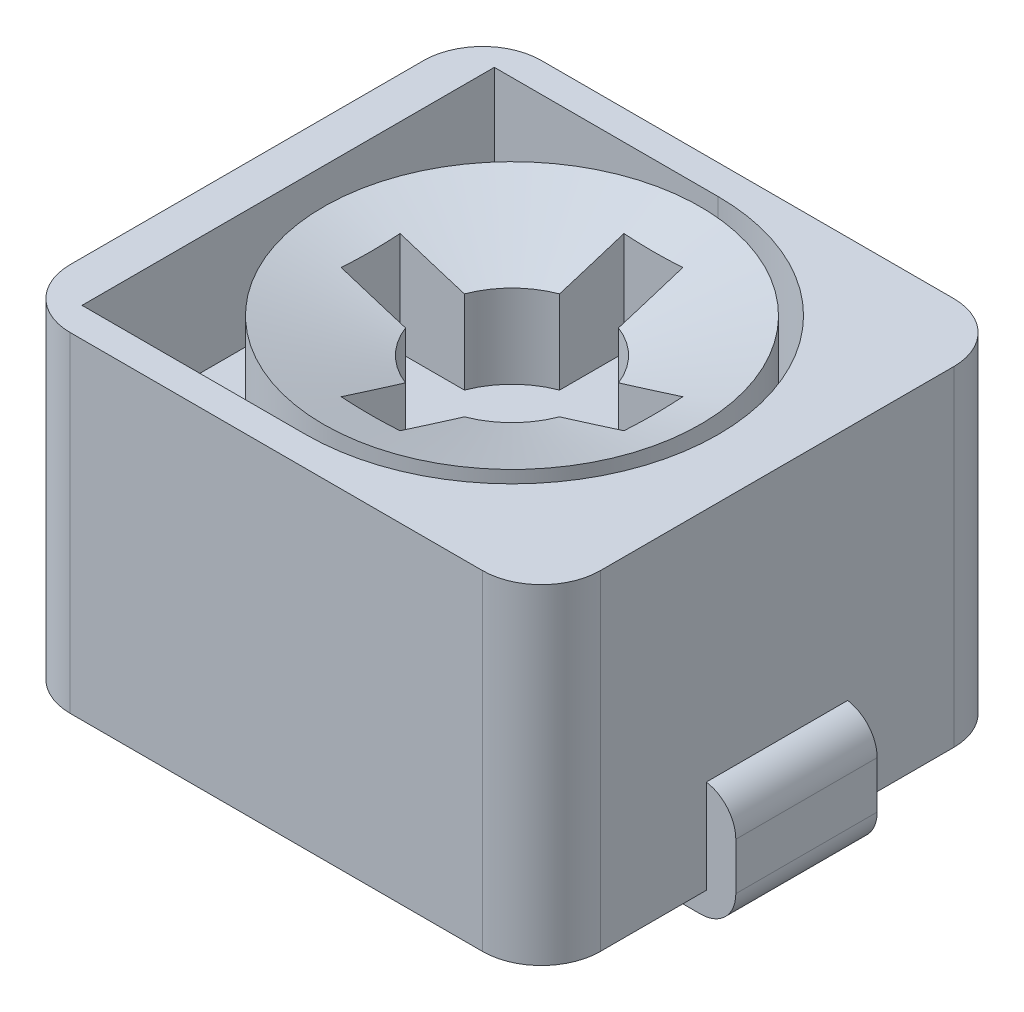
ISO-10303-21;
HEADER;
FILE_DESCRIPTION(('STEP AP214'),'2;1');
FILE_NAME('part.step','',(''),(''),'','','');
FILE_SCHEMA(('AUTOMOTIVE_DESIGN { 1 0 10303 214 1 1 1 1 }'));
ENDSEC;
DATA;
#1=APPLICATION_CONTEXT('core data for automotive mechanical design processes');
#2=APPLICATION_PROTOCOL_DEFINITION('international standard','automotive_design',2000,#1);
#3=PRODUCT_CONTEXT('',#1,'mechanical');
#4=PRODUCT('Part','Part','',(#3));
#5=PRODUCT_RELATED_PRODUCT_CATEGORY('part','',(#4));
#6=PRODUCT_DEFINITION_FORMATION('','',#4);
#7=PRODUCT_DEFINITION_CONTEXT('part definition',#1,'design');
#8=PRODUCT_DEFINITION('design','',#6,#7);
#9=PRODUCT_DEFINITION_SHAPE('','',#8);
#10=(LENGTH_UNIT() NAMED_UNIT(*) SI_UNIT(.MILLI.,.METRE.));
#11=(NAMED_UNIT(*) PLANE_ANGLE_UNIT() SI_UNIT($,.RADIAN.));
#12=(NAMED_UNIT(*) SI_UNIT($,.STERADIAN.) SOLID_ANGLE_UNIT());
#13=UNCERTAINTY_MEASURE_WITH_UNIT(LENGTH_MEASURE(1.E-05),#10,'distance_accuracy_value','');
#14=(GEOMETRIC_REPRESENTATION_CONTEXT(3) GLOBAL_UNCERTAINTY_ASSIGNED_CONTEXT((#13)) GLOBAL_UNIT_ASSIGNED_CONTEXT((#10,
#11,#12)) REPRESENTATION_CONTEXT('',''));
#15=CARTESIAN_POINT('',(0.,0.,0.));
#16=DIRECTION('',(0.,0.,1.));
#17=DIRECTION('',(1.,0.,0.));
#18=AXIS2_PLACEMENT_3D('',#15,#16,#17);
#19=CARTESIAN_POINT('',(-1.75,3.,-1.5));
#20=DIRECTION('',(0.,-1.,0.));
#21=DIRECTION('',(0.,0.,-1.));
#22=AXIS2_PLACEMENT_3D('',#19,#20,#21);
#23=PLANE('',#22);
#24=CARTESIAN_POINT('',(-1.75,3.,-1.5));
#25=DIRECTION('',(0.,1.,0.));
#26=DIRECTION('',(0.,0.,-1.));
#27=AXIS2_PLACEMENT_3D('',#24,#25,#26);
#28=CIRCLE('',#27,0.5);
#29=CARTESIAN_POINT('',(-1.75,3.,-2.));
#30=VERTEX_POINT('',#29);
#31=CARTESIAN_POINT('',(-2.25,3.,-1.5));
#32=VERTEX_POINT('',#31);
#33=EDGE_CURVE('E440',#30,#32,#28,.T.);
#34=ORIENTED_EDGE('',*,*,#33,.T.);
#35=DIRECTION('',(0.,0.,1.));
#36=VECTOR('',#35,1.);
#37=CARTESIAN_POINT('',(-2.25,3.,1.5));
#38=LINE('',#37,#36);
#39=CARTESIAN_POINT('',(-2.25,3.,1.5));
#40=VERTEX_POINT('',#39);
#41=EDGE_CURVE('E443',#32,#40,#38,.T.);
#42=ORIENTED_EDGE('',*,*,#41,.T.);
#43=CARTESIAN_POINT('',(-1.75,3.,1.5));
#44=DIRECTION('',(0.,1.,0.));
#45=DIRECTION('',(0.,0.,-1.));
#46=AXIS2_PLACEMENT_3D('',#43,#44,#45);
#47=CIRCLE('',#46,0.5);
#48=CARTESIAN_POINT('',(-1.75,3.,2.));
#49=VERTEX_POINT('',#48);
#50=EDGE_CURVE('E445',#40,#49,#47,.T.);
#51=ORIENTED_EDGE('',*,*,#50,.T.);
#52=DIRECTION('',(1.,0.,0.));
#53=VECTOR('',#52,1.);
#54=CARTESIAN_POINT('',(-1.75,3.,2.));
#55=LINE('',#54,#53);
#56=CARTESIAN_POINT('',(1.75,3.,2.));
#57=VERTEX_POINT('',#56);
#58=EDGE_CURVE('E447',#49,#57,#55,.T.);
#59=ORIENTED_EDGE('',*,*,#58,.T.);
#60=CARTESIAN_POINT('',(1.75,3.,1.5));
#61=DIRECTION('',(0.,1.,0.));
#62=DIRECTION('',(0.,0.,1.));
#63=AXIS2_PLACEMENT_3D('',#60,#61,#62);
#64=CIRCLE('',#63,0.5);
#65=CARTESIAN_POINT('',(2.25,3.,1.5));
#66=VERTEX_POINT('',#65);
#67=EDGE_CURVE('E449',#57,#66,#64,.T.);
#68=ORIENTED_EDGE('',*,*,#67,.T.);
#69=DIRECTION('',(0.,0.,-1.));
#70=VECTOR('',#69,1.);
#71=CARTESIAN_POINT('',(2.25,3.,1.5));
#72=LINE('',#71,#70);
#73=CARTESIAN_POINT('',(2.25,3.,-1.5));
#74=VERTEX_POINT('',#73);
#75=EDGE_CURVE('E451',#66,#74,#72,.T.);
#76=ORIENTED_EDGE('',*,*,#75,.T.);
#77=CARTESIAN_POINT('',(1.75,3.,-1.5));
#78=DIRECTION('',(0.,1.,0.));
#79=DIRECTION('',(0.,0.,-1.));
#80=AXIS2_PLACEMENT_3D('',#77,#78,#79);
#81=CIRCLE('',#80,0.5);
#82=CARTESIAN_POINT('',(1.75,3.,-2.));
#83=VERTEX_POINT('',#82);
#84=EDGE_CURVE('E453',#74,#83,#81,.T.);
#85=ORIENTED_EDGE('',*,*,#84,.T.);
#86=DIRECTION('',(-1.,0.,0.));
#87=VECTOR('',#86,1.);
#88=CARTESIAN_POINT('',(-1.75,3.,-2.));
#89=LINE('',#88,#87);
#90=EDGE_CURVE('E455',#83,#30,#89,.T.);
#91=ORIENTED_EDGE('',*,*,#90,.T.);
#92=EDGE_LOOP('',(#34,#42,#51,#59,#68,#76,#85,#91));
#93=FACE_BOUND('',#92,.T.);
#94=DIRECTION('',(-1.,0.,0.));
#95=VECTOR('',#94,1.);
#96=CARTESIAN_POINT('',(-4.82450260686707,3.,1.75));
#97=LINE('',#96,#95);
#98=CARTESIAN_POINT('',(0.,3.,1.75));
#99=VERTEX_POINT('',#98);
#100=CARTESIAN_POINT('',(-1.9,3.,1.75));
#101=VERTEX_POINT('',#100);
#102=EDGE_CURVE('E112',#99,#101,#97,.T.);
#103=ORIENTED_EDGE('',*,*,#102,.T.);
#104=DIRECTION('',(0.,0.,1.));
#105=VECTOR('',#104,1.);
#106=CARTESIAN_POINT('',(-1.9,3.,0.));
#107=LINE('',#106,#105);
#108=CARTESIAN_POINT('',(-1.9,3.,-1.75));
#109=VERTEX_POINT('',#108);
#110=EDGE_CURVE('E394',#109,#101,#107,.T.);
#111=ORIENTED_EDGE('',*,*,#110,.F.);
#112=DIRECTION('',(-1.,0.,0.));
#113=VECTOR('',#112,1.);
#114=CARTESIAN_POINT('',(-4.82450260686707,3.,-1.75));
#115=LINE('',#114,#113);
#116=CARTESIAN_POINT('',(0.,3.,-1.75));
#117=VERTEX_POINT('',#116);
#118=EDGE_CURVE('E391',#117,#109,#115,.T.);
#119=ORIENTED_EDGE('',*,*,#118,.F.);
#120=CARTESIAN_POINT('',(0.,3.,0.));
#121=DIRECTION('',(0.,1.,0.));
#122=DIRECTION('',(0.,0.,1.));
#123=AXIS2_PLACEMENT_3D('',#120,#121,#122);
#124=CIRCLE('',#123,1.75);
#125=EDGE_CURVE('E388',#99,#117,#124,.T.);
#126=ORIENTED_EDGE('',*,*,#125,.F.);
#127=EDGE_LOOP('',(#103,#111,#119,#126));
#128=FACE_BOUND('',#127,.T.);
#129=ADVANCED_FACE('F90',(#93,#128),#23,.F.);
#130=CARTESIAN_POINT('',(-2.2,0.7,0.6));
#131=DIRECTION('',(0.,0.,-1.));
#132=DIRECTION('',(-1.,0.,0.));
#133=AXIS2_PLACEMENT_3D('',#130,#131,#132);
#134=CYLINDRICAL_SURFACE('',#133,0.3);
#135=DIRECTION('',(0.,0.,-1.));
#136=VECTOR('',#135,1.);
#137=CARTESIAN_POINT('',(-2.25,0.995803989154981,0.6));
#138=LINE('',#137,#136);
#139=CARTESIAN_POINT('',(-2.25,0.995803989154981,-0.6));
#140=VERTEX_POINT('',#139);
#141=CARTESIAN_POINT('',(-2.25,0.995803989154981,0.6));
#142=VERTEX_POINT('',#141);
#143=EDGE_CURVE('E495',#140,#142,#138,.F.);
#144=ORIENTED_EDGE('',*,*,#143,.F.);
#145=CARTESIAN_POINT('',(-2.2,0.7,-0.6));
#146=DIRECTION('',(0.,0.,1.));
#147=DIRECTION('',(-1.,0.,0.));
#148=AXIS2_PLACEMENT_3D('',#145,#146,#147);
#149=CIRCLE('',#148,0.3);
#150=CARTESIAN_POINT('',(-2.5,0.7,-0.6));
#151=VERTEX_POINT('',#150);
#152=EDGE_CURVE('E514',#140,#151,#149,.T.);
#153=ORIENTED_EDGE('',*,*,#152,.T.);
#154=DIRECTION('',(0.,0.,-1.));
#155=VECTOR('',#154,1.);
#156=CARTESIAN_POINT('',(-2.5,0.7,0.6));
#157=LINE('',#156,#155);
#158=CARTESIAN_POINT('',(-2.5,0.7,0.6));
#159=VERTEX_POINT('',#158);
#160=EDGE_CURVE('E553',#159,#151,#157,.T.);
#161=ORIENTED_EDGE('',*,*,#160,.F.);
#162=CARTESIAN_POINT('',(-2.2,0.7,0.6));
#163=DIRECTION('',(0.,0.,1.));
#164=DIRECTION('',(-1.,0.,0.));
#165=AXIS2_PLACEMENT_3D('',#162,#163,#164);
#166=CIRCLE('',#165,0.3);
#167=EDGE_CURVE('E536',#142,#159,#166,.T.);
#168=ORIENTED_EDGE('',*,*,#167,.F.);
#169=EDGE_LOOP('',(#144,#153,#161,#168));
#170=FACE_BOUND('',#169,.T.);
#171=ADVANCED_FACE('F603',(#170),#134,.T.);
#172=CARTESIAN_POINT('',(2.2,0.3,0.6));
#173=DIRECTION('',(0.,0.,1.));
#174=DIRECTION('',(1.,0.,0.));
#175=AXIS2_PLACEMENT_3D('',#172,#173,#174);
#176=PLANE('',#175);
#177=DIRECTION('',(1.,0.,0.));
#178=VECTOR('',#177,1.);
#179=CARTESIAN_POINT('',(2.2,0.2,0.6));
#180=LINE('',#179,#178);
#181=CARTESIAN_POINT('',(-2.25,0.2,0.6));
#182=VERTEX_POINT('',#181);
#183=CARTESIAN_POINT('',(-1.35,0.2,0.6));
#184=VERTEX_POINT('',#183);
#185=EDGE_CURVE('E487',#182,#184,#180,.T.);
#186=ORIENTED_EDGE('',*,*,#185,.F.);
#187=DIRECTION('',(0.,1.,0.));
#188=VECTOR('',#187,1.);
#189=CARTESIAN_POINT('',(-2.25,0.3,0.6));
#190=LINE('',#189,#188);
#191=EDGE_CURVE('E497',#182,#142,#190,.T.);
#192=ORIENTED_EDGE('',*,*,#191,.T.);
#193=ORIENTED_EDGE('',*,*,#167,.T.);
#194=DIRECTION('',(0.,-1.,0.));
#195=VECTOR('',#194,1.);
#196=CARTESIAN_POINT('',(-2.5,0.3,0.6));
#197=LINE('',#196,#195);
#198=CARTESIAN_POINT('',(-2.5,0.3,0.6));
#199=VERTEX_POINT('',#198);
#200=EDGE_CURVE('E538',#159,#199,#197,.T.);
#201=ORIENTED_EDGE('',*,*,#200,.T.);
#202=CARTESIAN_POINT('',(-2.2,0.3,0.6));
#203=DIRECTION('',(0.,0.,1.));
#204=DIRECTION('',(-1.,0.,0.));
#205=AXIS2_PLACEMENT_3D('',#202,#203,#204);
#206=CIRCLE('',#205,0.3);
#207=CARTESIAN_POINT('',(-2.2,0.,0.6));
#208=VERTEX_POINT('',#207);
#209=EDGE_CURVE('E540',#199,#208,#206,.T.);
#210=ORIENTED_EDGE('',*,*,#209,.T.);
#211=DIRECTION('',(1.,0.,0.));
#212=VECTOR('',#211,1.);
#213=CARTESIAN_POINT('',(-2.2,0.,0.6));
#214=LINE('',#213,#212);
#215=CARTESIAN_POINT('',(-1.35,0.,0.6));
#216=VERTEX_POINT('',#215);
#217=EDGE_CURVE('E542',#208,#216,#214,.T.);
#218=ORIENTED_EDGE('',*,*,#217,.T.);
#219=DIRECTION('',(0.,1.,0.));
#220=VECTOR('',#219,1.);
#221=CARTESIAN_POINT('',(-1.35,0.,0.6));
#222=LINE('',#221,#220);
#223=EDGE_CURVE('E522',#216,#184,#222,.T.);
#224=ORIENTED_EDGE('',*,*,#223,.T.);
#225=EDGE_LOOP('',(#186,#192,#193,#201,#210,#218,#224));
#226=FACE_BOUND('',#225,.T.);
#227=ADVANCED_FACE('F608',(#226),#176,.T.);
#228=CARTESIAN_POINT('',(2.2,0.3,-0.6));
#229=DIRECTION('',(0.,0.,1.));
#230=DIRECTION('',(1.,0.,0.));
#231=AXIS2_PLACEMENT_3D('',#228,#229,#230);
#232=PLANE('',#231);
#233=DIRECTION('',(0.,1.,0.));
#234=VECTOR('',#233,1.);
#235=CARTESIAN_POINT('',(-2.25,0.3,-0.6));
#236=LINE('',#235,#234);
#237=CARTESIAN_POINT('',(-2.25,0.2,-0.6));
#238=VERTEX_POINT('',#237);
#239=EDGE_CURVE('E98',#238,#140,#236,.T.);
#240=ORIENTED_EDGE('',*,*,#239,.F.);
#241=DIRECTION('',(1.,0.,0.));
#242=VECTOR('',#241,1.);
#243=CARTESIAN_POINT('',(2.2,0.2,-0.6));
#244=LINE('',#243,#242);
#245=CARTESIAN_POINT('',(-1.35,0.2,-0.6));
#246=VERTEX_POINT('',#245);
#247=EDGE_CURVE('E572',#238,#246,#244,.T.);
#248=ORIENTED_EDGE('',*,*,#247,.T.);
#249=DIRECTION('',(0.,1.,0.));
#250=VECTOR('',#249,1.);
#251=CARTESIAN_POINT('',(-1.35,0.,-0.6));
#252=LINE('',#251,#250);
#253=CARTESIAN_POINT('',(-1.35,0.,-0.6));
#254=VERTEX_POINT('',#253);
#255=EDGE_CURVE('E500',#254,#246,#252,.T.);
#256=ORIENTED_EDGE('',*,*,#255,.F.);
#257=DIRECTION('',(1.,0.,0.));
#258=VECTOR('',#257,1.);
#259=CARTESIAN_POINT('',(-2.2,0.,-0.6));
#260=LINE('',#259,#258);
#261=CARTESIAN_POINT('',(-2.2,0.,-0.6));
#262=VERTEX_POINT('',#261);
#263=EDGE_CURVE('E520',#262,#254,#260,.T.);
#264=ORIENTED_EDGE('',*,*,#263,.F.);
#265=CARTESIAN_POINT('',(-2.2,0.3,-0.6));
#266=DIRECTION('',(0.,0.,1.));
#267=DIRECTION('',(-1.,0.,0.));
#268=AXIS2_PLACEMENT_3D('',#265,#266,#267);
#269=CIRCLE('',#268,0.3);
#270=CARTESIAN_POINT('',(-2.5,0.3,-0.6));
#271=VERTEX_POINT('',#270);
#272=EDGE_CURVE('E518',#271,#262,#269,.T.);
#273=ORIENTED_EDGE('',*,*,#272,.F.);
#274=DIRECTION('',(0.,-1.,0.));
#275=VECTOR('',#274,1.);
#276=CARTESIAN_POINT('',(-2.5,0.3,-0.6));
#277=LINE('',#276,#275);
#278=EDGE_CURVE('E516',#151,#271,#277,.T.);
#279=ORIENTED_EDGE('',*,*,#278,.F.);
#280=ORIENTED_EDGE('',*,*,#152,.F.);
#281=EDGE_LOOP('',(#240,#248,#256,#264,#273,#279,#280));
#282=FACE_BOUND('',#281,.T.);
#283=ADVANCED_FACE('F580',(#282),#232,.F.);
#284=CARTESIAN_POINT('',(-1.35,0.,0.6));
#285=DIRECTION('',(-1.,0.,0.));
#286=DIRECTION('',(0.,0.,1.));
#287=AXIS2_PLACEMENT_3D('',#284,#285,#286);
#288=PLANE('',#287);
#289=ORIENTED_EDGE('',*,*,#255,.T.);
#290=DIRECTION('',(0.,0.,1.));
#291=VECTOR('',#290,1.);
#292=CARTESIAN_POINT('',(-1.35,0.2,0.6));
#293=LINE('',#292,#291);
#294=EDGE_CURVE('E486',#246,#184,#293,.T.);
#295=ORIENTED_EDGE('',*,*,#294,.T.);
#296=ORIENTED_EDGE('',*,*,#223,.F.);
#297=DIRECTION('',(0.,0.,-1.));
#298=VECTOR('',#297,1.);
#299=CARTESIAN_POINT('',(-1.35,0.,0.6));
#300=LINE('',#299,#298);
#301=EDGE_CURVE('E544',#216,#254,#300,.T.);
#302=ORIENTED_EDGE('',*,*,#301,.T.);
#303=EDGE_LOOP('',(#289,#295,#296,#302));
#304=FACE_BOUND('',#303,.T.);
#305=ADVANCED_FACE('F92',(#304),#288,.F.);
#306=CARTESIAN_POINT('',(-2.5,0.3,0.6));
#307=DIRECTION('',(1.,0.,0.));
#308=DIRECTION('',(0.,1.,0.));
#309=AXIS2_PLACEMENT_3D('',#306,#307,#308);
#310=PLANE('',#309);
#311=ORIENTED_EDGE('',*,*,#278,.T.);
#312=DIRECTION('',(0.,0.,-1.));
#313=VECTOR('',#312,1.);
#314=CARTESIAN_POINT('',(-2.5,0.3,0.6));
#315=LINE('',#314,#313);
#316=EDGE_CURVE('E550',#199,#271,#315,.T.);
#317=ORIENTED_EDGE('',*,*,#316,.F.);
#318=ORIENTED_EDGE('',*,*,#200,.F.);
#319=ORIENTED_EDGE('',*,*,#160,.T.);
#320=EDGE_LOOP('',(#311,#317,#318,#319));
#321=FACE_BOUND('',#320,.T.);
#322=ADVANCED_FACE('F599',(#321),#310,.F.);
#323=CARTESIAN_POINT('',(-2.2,0.3,0.6));
#324=DIRECTION('',(0.,0.,-1.));
#325=DIRECTION('',(-1.,0.,0.));
#326=AXIS2_PLACEMENT_3D('',#323,#324,#325);
#327=CYLINDRICAL_SURFACE('',#326,0.3);
#328=ORIENTED_EDGE('',*,*,#272,.T.);
#329=DIRECTION('',(0.,0.,-1.));
#330=VECTOR('',#329,1.);
#331=CARTESIAN_POINT('',(-2.2,0.,0.6));
#332=LINE('',#331,#330);
#333=EDGE_CURVE('E547',#208,#262,#332,.T.);
#334=ORIENTED_EDGE('',*,*,#333,.F.);
#335=ORIENTED_EDGE('',*,*,#209,.F.);
#336=ORIENTED_EDGE('',*,*,#316,.T.);
#337=EDGE_LOOP('',(#328,#334,#335,#336));
#338=FACE_BOUND('',#337,.T.);
#339=ADVANCED_FACE('F594',(#338),#327,.T.);
#340=CARTESIAN_POINT('',(-2.2,0.,0.6));
#341=DIRECTION('',(0.,1.,0.));
#342=DIRECTION('',(0.,0.,1.));
#343=AXIS2_PLACEMENT_3D('',#340,#341,#342);
#344=PLANE('',#343);
#345=ORIENTED_EDGE('',*,*,#263,.T.);
#346=ORIENTED_EDGE('',*,*,#301,.F.);
#347=ORIENTED_EDGE('',*,*,#217,.F.);
#348=ORIENTED_EDGE('',*,*,#333,.T.);
#349=EDGE_LOOP('',(#345,#346,#347,#348));
#350=FACE_BOUND('',#349,.T.);
#351=ADVANCED_FACE('F589',(#350),#344,.F.);
#352=CARTESIAN_POINT('',(-1.75,3.,-1.5));
#353=DIRECTION('',(0.,-1.,0.));
#354=DIRECTION('',(0.,0.,-1.));
#355=AXIS2_PLACEMENT_3D('',#352,#353,#354);
#356=CYLINDRICAL_SURFACE('',#355,0.5);
#357=CARTESIAN_POINT('',(-1.75,0.2,-1.5));
#358=DIRECTION('',(0.,1.,0.));
#359=DIRECTION('',(0.,0.,-1.));
#360=AXIS2_PLACEMENT_3D('',#357,#358,#359);
#361=CIRCLE('',#360,0.5);
#362=CARTESIAN_POINT('',(-1.75,0.2,-2.));
#363=VERTEX_POINT('',#362);
#364=CARTESIAN_POINT('',(-2.25,0.2,-1.5));
#365=VERTEX_POINT('',#364);
#366=EDGE_CURVE('E414',#363,#365,#361,.T.);
#367=ORIENTED_EDGE('',*,*,#366,.T.);
#368=DIRECTION('',(0.,-1.,0.));
#369=VECTOR('',#368,1.);
#370=CARTESIAN_POINT('',(-2.25,3.,-1.5));
#371=LINE('',#370,#369);
#372=EDGE_CURVE('E478',#32,#365,#371,.T.);
#373=ORIENTED_EDGE('',*,*,#372,.F.);
#374=ORIENTED_EDGE('',*,*,#33,.F.);
#375=DIRECTION('',(0.,-1.,0.));
#376=VECTOR('',#375,1.);
#377=CARTESIAN_POINT('',(-1.75,3.,-2.));
#378=LINE('',#377,#376);
#379=EDGE_CURVE('E457',#30,#363,#378,.T.);
#380=ORIENTED_EDGE('',*,*,#379,.T.);
#381=EDGE_LOOP('',(#367,#373,#374,#380));
#382=FACE_BOUND('',#381,.T.);
#383=ADVANCED_FACE('F625',(#382),#356,.T.);
#384=CARTESIAN_POINT('',(-2.25,3.,1.5));
#385=DIRECTION('',(1.,0.,0.));
#386=DIRECTION('',(0.,0.,-1.));
#387=AXIS2_PLACEMENT_3D('',#384,#385,#386);
#388=PLANE('',#387);
#389=ORIENTED_EDGE('',*,*,#191,.F.);
#390=DIRECTION('',(0.,0.,1.));
#391=VECTOR('',#390,1.);
#392=CARTESIAN_POINT('',(-2.25,0.2,1.5));
#393=LINE('',#392,#391);
#394=CARTESIAN_POINT('',(-2.25,0.2,1.5));
#395=VERTEX_POINT('',#394);
#396=EDGE_CURVE('E422',#182,#395,#393,.T.);
#397=ORIENTED_EDGE('',*,*,#396,.T.);
#398=DIRECTION('',(0.,-1.,0.));
#399=VECTOR('',#398,1.);
#400=CARTESIAN_POINT('',(-2.25,3.,1.5));
#401=LINE('',#400,#399);
#402=EDGE_CURVE('E475',#40,#395,#401,.T.);
#403=ORIENTED_EDGE('',*,*,#402,.F.);
#404=ORIENTED_EDGE('',*,*,#41,.F.);
#405=ORIENTED_EDGE('',*,*,#372,.T.);
#406=EDGE_CURVE('E423',#365,#238,#393,.T.);
#407=ORIENTED_EDGE('',*,*,#406,.T.);
#408=ORIENTED_EDGE('',*,*,#239,.T.);
#409=ORIENTED_EDGE('',*,*,#143,.T.);
#410=EDGE_LOOP('',(#389,#397,#403,#404,#405,#407,#408,#409));
#411=FACE_BOUND('',#410,.T.);
#412=ADVANCED_FACE('F604',(#411),#388,.F.);
#413=CARTESIAN_POINT('',(-1.75,3.,1.5));
#414=DIRECTION('',(0.,-1.,0.));
#415=DIRECTION('',(0.,0.,-1.));
#416=AXIS2_PLACEMENT_3D('',#413,#414,#415);
#417=CYLINDRICAL_SURFACE('',#416,0.5);
#418=CARTESIAN_POINT('',(-1.75,0.2,1.5));
#419=DIRECTION('',(0.,1.,0.));
#420=DIRECTION('',(0.,0.,-1.));
#421=AXIS2_PLACEMENT_3D('',#418,#419,#420);
#422=CIRCLE('',#421,0.5);
#423=CARTESIAN_POINT('',(-1.75,0.2,2.));
#424=VERTEX_POINT('',#423);
#425=EDGE_CURVE('E426',#395,#424,#422,.T.);
#426=ORIENTED_EDGE('',*,*,#425,.T.);
#427=DIRECTION('',(0.,-1.,0.));
#428=VECTOR('',#427,1.);
#429=CARTESIAN_POINT('',(-1.75,3.,2.));
#430=LINE('',#429,#428);
#431=EDGE_CURVE('E472',#49,#424,#430,.T.);
#432=ORIENTED_EDGE('',*,*,#431,.F.);
#433=ORIENTED_EDGE('',*,*,#50,.F.);
#434=ORIENTED_EDGE('',*,*,#402,.T.);
#435=EDGE_LOOP('',(#426,#432,#433,#434));
#436=FACE_BOUND('',#435,.T.);
#437=ADVANCED_FACE('F615',(#436),#417,.T.);
#438=CARTESIAN_POINT('',(-1.75,3.,2.));
#439=DIRECTION('',(0.,0.,-1.));
#440=DIRECTION('',(-1.,0.,0.));
#441=AXIS2_PLACEMENT_3D('',#438,#439,#440);
#442=PLANE('',#441);
#443=DIRECTION('',(1.,0.,0.));
#444=VECTOR('',#443,1.);
#445=CARTESIAN_POINT('',(-1.75,0.2,2.));
#446=LINE('',#445,#444);
#447=CARTESIAN_POINT('',(1.75,0.2,2.));
#448=VERTEX_POINT('',#447);
#449=EDGE_CURVE('E428',#424,#448,#446,.T.);
#450=ORIENTED_EDGE('',*,*,#449,.T.);
#451=DIRECTION('',(0.,-1.,0.));
#452=VECTOR('',#451,1.);
#453=CARTESIAN_POINT('',(1.75,3.,2.));
#454=LINE('',#453,#452);
#455=EDGE_CURVE('E469',#57,#448,#454,.T.);
#456=ORIENTED_EDGE('',*,*,#455,.F.);
#457=ORIENTED_EDGE('',*,*,#58,.F.);
#458=ORIENTED_EDGE('',*,*,#431,.T.);
#459=EDGE_LOOP('',(#450,#456,#457,#458));
#460=FACE_BOUND('',#459,.T.);
#461=ADVANCED_FACE('F672',(#460),#442,.F.);
#462=CARTESIAN_POINT('',(1.75,3.,1.5));
#463=DIRECTION('',(0.,-1.,0.));
#464=DIRECTION('',(0.,0.,-1.));
#465=AXIS2_PLACEMENT_3D('',#462,#463,#464);
#466=CYLINDRICAL_SURFACE('',#465,0.5);
#467=CARTESIAN_POINT('',(1.75,0.2,1.5));
#468=DIRECTION('',(0.,1.,0.));
#469=DIRECTION('',(0.,0.,1.));
#470=AXIS2_PLACEMENT_3D('',#467,#468,#469);
#471=CIRCLE('',#470,0.5);
#472=CARTESIAN_POINT('',(2.25,0.2,1.5));
#473=VERTEX_POINT('',#472);
#474=EDGE_CURVE('E430',#448,#473,#471,.T.);
#475=ORIENTED_EDGE('',*,*,#474,.T.);
#476=DIRECTION('',(0.,-1.,0.));
#477=VECTOR('',#476,1.);
#478=CARTESIAN_POINT('',(2.25,3.,1.5));
#479=LINE('',#478,#477);
#480=EDGE_CURVE('E466',#66,#473,#479,.T.);
#481=ORIENTED_EDGE('',*,*,#480,.F.);
#482=ORIENTED_EDGE('',*,*,#67,.F.);
#483=ORIENTED_EDGE('',*,*,#455,.T.);
#484=EDGE_LOOP('',(#475,#481,#482,#483));
#485=FACE_BOUND('',#484,.T.);
#486=ADVANCED_FACE('F670',(#485),#466,.T.);
#487=CARTESIAN_POINT('',(2.25,3.,1.5));
#488=DIRECTION('',(-1.,0.,0.));
#489=DIRECTION('',(0.,0.,1.));
#490=AXIS2_PLACEMENT_3D('',#487,#488,#489);
#491=PLANE('',#490);
#492=DIRECTION('',(0.,-1.,0.));
#493=VECTOR('',#492,1.);
#494=CARTESIAN_POINT('',(2.25,0.3,0.6));
#495=LINE('',#494,#493);
#496=CARTESIAN_POINT('',(2.25,0.995803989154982,0.6));
#497=VERTEX_POINT('',#496);
#498=CARTESIAN_POINT('',(2.25,0.2,0.6));
#499=VERTEX_POINT('',#498);
#500=EDGE_CURVE('E492',#497,#499,#495,.T.);
#501=ORIENTED_EDGE('',*,*,#500,.F.);
#502=DIRECTION('',(0.,0.,-1.));
#503=VECTOR('',#502,1.);
#504=CARTESIAN_POINT('',(2.25,0.995803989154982,0.6));
#505=LINE('',#504,#503);
#506=CARTESIAN_POINT('',(2.25,0.995803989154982,-0.6));
#507=VERTEX_POINT('',#506);
#508=EDGE_CURVE('E490',#497,#507,#505,.T.);
#509=ORIENTED_EDGE('',*,*,#508,.T.);
#510=DIRECTION('',(0.,-1.,0.));
#511=VECTOR('',#510,1.);
#512=CARTESIAN_POINT('',(2.25,0.3,-0.6));
#513=LINE('',#512,#511);
#514=CARTESIAN_POINT('',(2.25,0.2,-0.6));
#515=VERTEX_POINT('',#514);
#516=EDGE_CURVE('E571',#507,#515,#513,.T.);
#517=ORIENTED_EDGE('',*,*,#516,.T.);
#518=DIRECTION('',(0.,0.,-1.));
#519=VECTOR('',#518,1.);
#520=CARTESIAN_POINT('',(2.25,0.2,1.5));
#521=LINE('',#520,#519);
#522=CARTESIAN_POINT('',(2.25,0.2,-1.5));
#523=VERTEX_POINT('',#522);
#524=EDGE_CURVE('E432',#515,#523,#521,.T.);
#525=ORIENTED_EDGE('',*,*,#524,.T.);
#526=DIRECTION('',(0.,-1.,0.));
#527=VECTOR('',#526,1.);
#528=CARTESIAN_POINT('',(2.25,3.,-1.5));
#529=LINE('',#528,#527);
#530=EDGE_CURVE('E463',#74,#523,#529,.T.);
#531=ORIENTED_EDGE('',*,*,#530,.F.);
#532=ORIENTED_EDGE('',*,*,#75,.F.);
#533=ORIENTED_EDGE('',*,*,#480,.T.);
#534=EDGE_CURVE('E433',#473,#499,#521,.T.);
#535=ORIENTED_EDGE('',*,*,#534,.T.);
#536=EDGE_LOOP('',(#501,#509,#517,#525,#531,#532,#533,#535));
#537=FACE_BOUND('',#536,.T.);
#538=ADVANCED_FACE('F639',(#537),#491,.F.);
#539=CARTESIAN_POINT('',(1.75,3.,-1.5));
#540=DIRECTION('',(0.,-1.,0.));
#541=DIRECTION('',(0.,0.,-1.));
#542=AXIS2_PLACEMENT_3D('',#539,#540,#541);
#543=CYLINDRICAL_SURFACE('',#542,0.5);
#544=CARTESIAN_POINT('',(1.75,0.2,-1.5));
#545=DIRECTION('',(0.,1.,0.));
#546=DIRECTION('',(0.,0.,-1.));
#547=AXIS2_PLACEMENT_3D('',#544,#545,#546);
#548=CIRCLE('',#547,0.5);
#549=CARTESIAN_POINT('',(1.75,0.2,-2.));
#550=VERTEX_POINT('',#549);
#551=EDGE_CURVE('E436',#523,#550,#548,.T.);
#552=ORIENTED_EDGE('',*,*,#551,.T.);
#553=DIRECTION('',(0.,-1.,0.));
#554=VECTOR('',#553,1.);
#555=CARTESIAN_POINT('',(1.75,3.,-2.));
#556=LINE('',#555,#554);
#557=EDGE_CURVE('E460',#83,#550,#556,.T.);
#558=ORIENTED_EDGE('',*,*,#557,.F.);
#559=ORIENTED_EDGE('',*,*,#84,.F.);
#560=ORIENTED_EDGE('',*,*,#530,.T.);
#561=EDGE_LOOP('',(#552,#558,#559,#560));
#562=FACE_BOUND('',#561,.T.);
#563=ADVANCED_FACE('F635',(#562),#543,.T.);
#564=CARTESIAN_POINT('',(-1.75,3.,-2.));
#565=DIRECTION('',(0.,0.,1.));
#566=DIRECTION('',(1.,0.,0.));
#567=AXIS2_PLACEMENT_3D('',#564,#565,#566);
#568=PLANE('',#567);
#569=DIRECTION('',(-1.,0.,0.));
#570=VECTOR('',#569,1.);
#571=CARTESIAN_POINT('',(-1.75,0.2,-2.));
#572=LINE('',#571,#570);
#573=EDGE_CURVE('E438',#550,#363,#572,.T.);
#574=ORIENTED_EDGE('',*,*,#573,.T.);
#575=ORIENTED_EDGE('',*,*,#379,.F.);
#576=ORIENTED_EDGE('',*,*,#90,.F.);
#577=ORIENTED_EDGE('',*,*,#557,.T.);
#578=EDGE_LOOP('',(#574,#575,#576,#577));
#579=FACE_BOUND('',#578,.T.);
#580=ADVANCED_FACE('F630',(#579),#568,.F.);
#581=CARTESIAN_POINT('',(-1.75,0.2,-1.5));
#582=DIRECTION('',(0.,-1.,0.));
#583=DIRECTION('',(0.,0.,-1.));
#584=AXIS2_PLACEMENT_3D('',#581,#582,#583);
#585=PLANE('',#584);
#586=ORIENTED_EDGE('',*,*,#396,.F.);
#587=ORIENTED_EDGE('',*,*,#185,.T.);
#588=ORIENTED_EDGE('',*,*,#294,.F.);
#589=ORIENTED_EDGE('',*,*,#247,.F.);
#590=ORIENTED_EDGE('',*,*,#406,.F.);
#591=ORIENTED_EDGE('',*,*,#366,.F.);
#592=ORIENTED_EDGE('',*,*,#573,.F.);
#593=ORIENTED_EDGE('',*,*,#551,.F.);
#594=ORIENTED_EDGE('',*,*,#524,.F.);
#595=CARTESIAN_POINT('',(1.35,0.2,-0.6));
#596=VERTEX_POINT('',#595);
#597=EDGE_CURVE('E568',#596,#515,#244,.T.);
#598=ORIENTED_EDGE('',*,*,#597,.F.);
#599=DIRECTION('',(0.,0.,-1.));
#600=VECTOR('',#599,1.);
#601=CARTESIAN_POINT('',(1.35,0.2,0.6));
#602=LINE('',#601,#600);
#603=CARTESIAN_POINT('',(1.35,0.2,0.6));
#604=VERTEX_POINT('',#603);
#605=EDGE_CURVE('E481',#604,#596,#602,.T.);
#606=ORIENTED_EDGE('',*,*,#605,.F.);
#607=EDGE_CURVE('E484',#604,#499,#180,.T.);
#608=ORIENTED_EDGE('',*,*,#607,.T.);
#609=ORIENTED_EDGE('',*,*,#534,.F.);
#610=ORIENTED_EDGE('',*,*,#474,.F.);
#611=ORIENTED_EDGE('',*,*,#449,.F.);
#612=ORIENTED_EDGE('',*,*,#425,.F.);
#613=EDGE_LOOP('',(#586,#587,#588,#589,#590,#591,#592,#593,#594,#598,#606,#608,#609,#610,#611,#612));
#614=FACE_BOUND('',#613,.T.);
#615=ADVANCED_FACE('F609',(#614),#585,.T.);
#616=CARTESIAN_POINT('',(1.35,0.,0.6));
#617=DIRECTION('',(0.,1.,0.));
#618=DIRECTION('',(-1.,0.,0.));
#619=AXIS2_PLACEMENT_3D('',#616,#617,#618);
#620=PLANE('',#619);
#621=DIRECTION('',(1.,0.,0.));
#622=VECTOR('',#621,1.);
#623=CARTESIAN_POINT('',(1.35,0.,-0.6));
#624=LINE('',#623,#622);
#625=CARTESIAN_POINT('',(1.35,0.,-0.6));
#626=VERTEX_POINT('',#625);
#627=CARTESIAN_POINT('',(2.2,0.,-0.6));
#628=VERTEX_POINT('',#627);
#629=EDGE_CURVE('E505',#626,#628,#624,.T.);
#630=ORIENTED_EDGE('',*,*,#629,.T.);
#631=DIRECTION('',(0.,0.,-1.));
#632=VECTOR('',#631,1.);
#633=CARTESIAN_POINT('',(2.2,0.,0.6));
#634=LINE('',#633,#632);
#635=CARTESIAN_POINT('',(2.2,0.,0.6));
#636=VERTEX_POINT('',#635);
#637=EDGE_CURVE('E562',#636,#628,#634,.T.);
#638=ORIENTED_EDGE('',*,*,#637,.F.);
#639=DIRECTION('',(1.,0.,0.));
#640=VECTOR('',#639,1.);
#641=CARTESIAN_POINT('',(1.35,0.,0.6));
#642=LINE('',#641,#640);
#643=CARTESIAN_POINT('',(1.35,0.,0.6));
#644=VERTEX_POINT('',#643);
#645=EDGE_CURVE('E527',#644,#636,#642,.T.);
#646=ORIENTED_EDGE('',*,*,#645,.F.);
#647=DIRECTION('',(0.,0.,-1.));
#648=VECTOR('',#647,1.);
#649=CARTESIAN_POINT('',(1.35,0.,0.6));
#650=LINE('',#649,#648);
#651=EDGE_CURVE('E565',#644,#626,#650,.T.);
#652=ORIENTED_EDGE('',*,*,#651,.T.);
#653=EDGE_LOOP('',(#630,#638,#646,#652));
#654=FACE_BOUND('',#653,.T.);
#655=ADVANCED_FACE('F654',(#654),#620,.F.);
#656=CARTESIAN_POINT('',(2.2,0.3,0.6));
#657=DIRECTION('',(0.,0.,-1.));
#658=DIRECTION('',(-1.,0.,0.));
#659=AXIS2_PLACEMENT_3D('',#656,#657,#658);
#660=CYLINDRICAL_SURFACE('',#659,0.3);
#661=CARTESIAN_POINT('',(2.2,0.3,-0.6));
#662=DIRECTION('',(0.,0.,1.));
#663=DIRECTION('',(1.,0.,0.));
#664=AXIS2_PLACEMENT_3D('',#661,#662,#663);
#665=CIRCLE('',#664,0.3);
#666=CARTESIAN_POINT('',(2.5,0.3,-0.6));
#667=VERTEX_POINT('',#666);
#668=EDGE_CURVE('E507',#628,#667,#665,.T.);
#669=ORIENTED_EDGE('',*,*,#668,.T.);
#670=DIRECTION('',(0.,0.,-1.));
#671=VECTOR('',#670,1.);
#672=CARTESIAN_POINT('',(2.5,0.3,0.6));
#673=LINE('',#672,#671);
#674=CARTESIAN_POINT('',(2.5,0.3,0.6));
#675=VERTEX_POINT('',#674);
#676=EDGE_CURVE('E559',#675,#667,#673,.T.);
#677=ORIENTED_EDGE('',*,*,#676,.F.);
#678=CARTESIAN_POINT('',(2.2,0.3,0.6));
#679=DIRECTION('',(0.,0.,1.));
#680=DIRECTION('',(1.,0.,0.));
#681=AXIS2_PLACEMENT_3D('',#678,#679,#680);
#682=CIRCLE('',#681,0.3);
#683=EDGE_CURVE('E529',#636,#675,#682,.T.);
#684=ORIENTED_EDGE('',*,*,#683,.F.);
#685=ORIENTED_EDGE('',*,*,#637,.T.);
#686=EDGE_LOOP('',(#669,#677,#684,#685));
#687=FACE_BOUND('',#686,.T.);
#688=ADVANCED_FACE('F658',(#687),#660,.T.);
#689=CARTESIAN_POINT('',(2.5,0.3,0.6));
#690=DIRECTION('',(-1.,0.,0.));
#691=DIRECTION('',(0.,-1.,0.));
#692=AXIS2_PLACEMENT_3D('',#689,#690,#691);
#693=PLANE('',#692);
#694=DIRECTION('',(0.,1.,0.));
#695=VECTOR('',#694,1.);
#696=CARTESIAN_POINT('',(2.5,0.3,-0.6));
#697=LINE('',#696,#695);
#698=CARTESIAN_POINT('',(2.5,0.700000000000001,-0.6));
#699=VERTEX_POINT('',#698);
#700=EDGE_CURVE('E509',#667,#699,#697,.T.);
#701=ORIENTED_EDGE('',*,*,#700,.T.);
#702=DIRECTION('',(0.,0.,-1.));
#703=VECTOR('',#702,1.);
#704=CARTESIAN_POINT('',(2.5,0.700000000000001,0.6));
#705=LINE('',#704,#703);
#706=CARTESIAN_POINT('',(2.5,0.700000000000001,0.6));
#707=VERTEX_POINT('',#706);
#708=EDGE_CURVE('E556',#707,#699,#705,.T.);
#709=ORIENTED_EDGE('',*,*,#708,.F.);
#710=DIRECTION('',(0.,1.,0.));
#711=VECTOR('',#710,1.);
#712=CARTESIAN_POINT('',(2.5,0.3,0.6));
#713=LINE('',#712,#711);
#714=EDGE_CURVE('E531',#675,#707,#713,.T.);
#715=ORIENTED_EDGE('',*,*,#714,.F.);
#716=ORIENTED_EDGE('',*,*,#676,.T.);
#717=EDGE_LOOP('',(#701,#709,#715,#716));
#718=FACE_BOUND('',#717,.T.);
#719=ADVANCED_FACE('F725',(#718),#693,.F.);
#720=ORIENTED_EDGE('',*,*,#516,.F.);
#721=CARTESIAN_POINT('',(2.2,0.700000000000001,-0.6));
#722=DIRECTION('',(0.,0.,1.));
#723=DIRECTION('',(-1.,0.,0.));
#724=AXIS2_PLACEMENT_3D('',#721,#722,#723);
#725=CIRCLE('',#724,0.3);
#726=EDGE_CURVE('E511',#699,#507,#725,.T.);
#727=ORIENTED_EDGE('',*,*,#726,.F.);
#728=ORIENTED_EDGE('',*,*,#700,.F.);
#729=ORIENTED_EDGE('',*,*,#668,.F.);
#730=ORIENTED_EDGE('',*,*,#629,.F.);
#731=DIRECTION('',(0.,-1.,0.));
#732=VECTOR('',#731,1.);
#733=CARTESIAN_POINT('',(1.35,0.,-0.6));
#734=LINE('',#733,#732);
#735=EDGE_CURVE('E503',#596,#626,#734,.T.);
#736=ORIENTED_EDGE('',*,*,#735,.F.);
#737=ORIENTED_EDGE('',*,*,#597,.T.);
#738=EDGE_LOOP('',(#720,#727,#728,#729,#730,#736,#737));
#739=FACE_BOUND('',#738,.T.);
#740=ADVANCED_FACE('F649',(#739),#232,.F.);
#741=CARTESIAN_POINT('',(2.2,0.700000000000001,0.6));
#742=DIRECTION('',(0.,0.,1.));
#743=DIRECTION('',(-1.,0.,0.));
#744=AXIS2_PLACEMENT_3D('',#741,#742,#743);
#745=CIRCLE('',#744,0.3);
#746=EDGE_CURVE('E533',#707,#497,#745,.T.);
#747=ORIENTED_EDGE('',*,*,#746,.T.);
#748=ORIENTED_EDGE('',*,*,#500,.T.);
#749=ORIENTED_EDGE('',*,*,#607,.F.);
#750=DIRECTION('',(0.,-1.,0.));
#751=VECTOR('',#750,1.);
#752=CARTESIAN_POINT('',(1.35,0.,0.6));
#753=LINE('',#752,#751);
#754=EDGE_CURVE('E525',#604,#644,#753,.T.);
#755=ORIENTED_EDGE('',*,*,#754,.T.);
#756=ORIENTED_EDGE('',*,*,#645,.T.);
#757=ORIENTED_EDGE('',*,*,#683,.T.);
#758=ORIENTED_EDGE('',*,*,#714,.T.);
#759=EDGE_LOOP('',(#747,#748,#749,#755,#756,#757,#758));
#760=FACE_BOUND('',#759,.T.);
#761=ADVANCED_FACE('F662',(#760),#176,.T.);
#762=CARTESIAN_POINT('',(2.2,0.700000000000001,0.6));
#763=DIRECTION('',(0.,0.,-1.));
#764=DIRECTION('',(-1.,0.,0.));
#765=AXIS2_PLACEMENT_3D('',#762,#763,#764);
#766=CYLINDRICAL_SURFACE('',#765,0.3);
#767=ORIENTED_EDGE('',*,*,#508,.F.);
#768=ORIENTED_EDGE('',*,*,#746,.F.);
#769=ORIENTED_EDGE('',*,*,#708,.T.);
#770=ORIENTED_EDGE('',*,*,#726,.T.);
#771=EDGE_LOOP('',(#767,#768,#769,#770));
#772=FACE_BOUND('',#771,.T.);
#773=ADVANCED_FACE('F745',(#772),#766,.T.);
#774=CARTESIAN_POINT('',(1.35,0.,0.6));
#775=DIRECTION('',(1.,0.,0.));
#776=DIRECTION('',(0.,1.,0.));
#777=AXIS2_PLACEMENT_3D('',#774,#775,#776);
#778=PLANE('',#777);
#779=ORIENTED_EDGE('',*,*,#754,.F.);
#780=ORIENTED_EDGE('',*,*,#605,.T.);
#781=ORIENTED_EDGE('',*,*,#735,.T.);
#782=ORIENTED_EDGE('',*,*,#651,.F.);
#783=EDGE_LOOP('',(#779,#780,#781,#782));
#784=FACE_BOUND('',#783,.T.);
#785=ADVANCED_FACE('F646',(#784),#778,.F.);
#786=CARTESIAN_POINT('',(-4.82450260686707,2.,1.75));
#787=DIRECTION('',(0.,0.,-1.));
#788=DIRECTION('',(-1.,0.,0.));
#789=AXIS2_PLACEMENT_3D('',#786,#787,#788);
#790=PLANE('',#789);
#791=ORIENTED_EDGE('',*,*,#102,.F.);
#792=DIRECTION('',(0.,1.,0.));
#793=VECTOR('',#792,1.);
#794=CARTESIAN_POINT('',(0.,2.,1.75));
#795=LINE('',#794,#793);
#796=CARTESIAN_POINT('',(0.,2.,1.75));
#797=VERTEX_POINT('',#796);
#798=EDGE_CURVE('E411',#797,#99,#795,.T.);
#799=ORIENTED_EDGE('',*,*,#798,.F.);
#800=DIRECTION('',(-1.,0.,0.));
#801=VECTOR('',#800,1.);
#802=CARTESIAN_POINT('',(-4.82450260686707,2.,1.75));
#803=LINE('',#802,#801);
#804=CARTESIAN_POINT('',(-1.9,2.,1.75));
#805=VERTEX_POINT('',#804);
#806=EDGE_CURVE('E400',#797,#805,#803,.T.);
#807=ORIENTED_EDGE('',*,*,#806,.T.);
#808=DIRECTION('',(0.,1.,0.));
#809=VECTOR('',#808,1.);
#810=CARTESIAN_POINT('',(-1.9,2.,1.75));
#811=LINE('',#810,#809);
#812=EDGE_CURVE('E412',#805,#101,#811,.T.);
#813=ORIENTED_EDGE('',*,*,#812,.T.);
#814=EDGE_LOOP('',(#791,#799,#807,#813));
#815=FACE_BOUND('',#814,.T.);
#816=ADVANCED_FACE('F759',(#815),#790,.T.);
#817=CARTESIAN_POINT('',(-1.9,2.,0.));
#818=DIRECTION('',(-1.,0.,0.));
#819=DIRECTION('',(0.,0.,1.));
#820=AXIS2_PLACEMENT_3D('',#817,#818,#819);
#821=PLANE('',#820);
#822=ORIENTED_EDGE('',*,*,#110,.T.);
#823=ORIENTED_EDGE('',*,*,#812,.F.);
#824=DIRECTION('',(0.,0.,1.));
#825=VECTOR('',#824,1.);
#826=CARTESIAN_POINT('',(-1.9,2.,0.));
#827=LINE('',#826,#825);
#828=CARTESIAN_POINT('',(-1.9,2.,-1.75));
#829=VERTEX_POINT('',#828);
#830=EDGE_CURVE('E408',#829,#805,#827,.T.);
#831=ORIENTED_EDGE('',*,*,#830,.F.);
#832=DIRECTION('',(0.,1.,0.));
#833=VECTOR('',#832,1.);
#834=CARTESIAN_POINT('',(-1.9,2.,-1.75));
#835=LINE('',#834,#833);
#836=EDGE_CURVE('E415',#829,#109,#835,.T.);
#837=ORIENTED_EDGE('',*,*,#836,.T.);
#838=EDGE_LOOP('',(#822,#823,#831,#837));
#839=FACE_BOUND('',#838,.T.);
#840=ADVANCED_FACE('F765',(#839),#821,.F.);
#841=CARTESIAN_POINT('',(-4.82450260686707,2.,-1.75));
#842=DIRECTION('',(0.,0.,-1.));
#843=DIRECTION('',(-1.,0.,0.));
#844=AXIS2_PLACEMENT_3D('',#841,#842,#843);
#845=PLANE('',#844);
#846=ORIENTED_EDGE('',*,*,#118,.T.);
#847=ORIENTED_EDGE('',*,*,#836,.F.);
#848=DIRECTION('',(-1.,0.,0.));
#849=VECTOR('',#848,1.);
#850=CARTESIAN_POINT('',(-4.82450260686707,2.,-1.75));
#851=LINE('',#850,#849);
#852=CARTESIAN_POINT('',(0.,2.,-1.75));
#853=VERTEX_POINT('',#852);
#854=EDGE_CURVE('E405',#853,#829,#851,.T.);
#855=ORIENTED_EDGE('',*,*,#854,.F.);
#856=DIRECTION('',(0.,1.,0.));
#857=VECTOR('',#856,1.);
#858=CARTESIAN_POINT('',(0.,2.,-1.75));
#859=LINE('',#858,#857);
#860=EDGE_CURVE('E417',#853,#117,#859,.T.);
#861=ORIENTED_EDGE('',*,*,#860,.T.);
#862=EDGE_LOOP('',(#846,#847,#855,#861));
#863=FACE_BOUND('',#862,.T.);
#864=ADVANCED_FACE('F772',(#863),#845,.F.);
#865=CARTESIAN_POINT('',(0.,2.,0.));
#866=DIRECTION('',(0.,1.,0.));
#867=DIRECTION('',(0.,0.,1.));
#868=AXIS2_PLACEMENT_3D('',#865,#866,#867);
#869=CYLINDRICAL_SURFACE('',#868,1.6);
#870=CARTESIAN_POINT('',(0.,2.,0.));
#871=DIRECTION('',(0.,1.,0.));
#872=DIRECTION('',(0.,0.,1.));
#873=AXIS2_PLACEMENT_3D('',#870,#871,#872);
#874=CIRCLE('',#873,1.6);
#875=CARTESIAN_POINT('',(0.,2.,1.6));
#876=VERTEX_POINT('',#875);
#877=EDGE_CURVE('E397',#876,#876,#874,.T.);
#878=ORIENTED_EDGE('',*,*,#877,.T.);
#879=EDGE_LOOP('',(#878));
#880=FACE_BOUND('',#879,.T.);
#881=CARTESIAN_POINT('',(0.,3.,0.));
#882=DIRECTION('',(0.,1.,0.));
#883=DIRECTION('',(0.,0.,1.));
#884=AXIS2_PLACEMENT_3D('',#881,#882,#883);
#885=CIRCLE('',#884,1.6);
#886=CARTESIAN_POINT('',(0.,3.,1.6));
#887=VERTEX_POINT('',#886);
#888=EDGE_CURVE('E1209',#887,#887,#885,.T.);
#889=ORIENTED_EDGE('',*,*,#888,.F.);
#890=EDGE_LOOP('',(#889));
#891=FACE_BOUND('',#890,.T.);
#892=ADVANCED_FACE('F780',(#880,#891),#869,.T.);
#893=CARTESIAN_POINT('',(0.,2.,0.));
#894=DIRECTION('',(0.,1.,0.));
#895=DIRECTION('',(0.,0.,1.));
#896=AXIS2_PLACEMENT_3D('',#893,#894,#895);
#897=CYLINDRICAL_SURFACE('',#896,1.75);
#898=ORIENTED_EDGE('',*,*,#125,.T.);
#899=ORIENTED_EDGE('',*,*,#860,.F.);
#900=CARTESIAN_POINT('',(0.,2.,0.));
#901=DIRECTION('',(0.,1.,0.));
#902=DIRECTION('',(0.,0.,1.));
#903=AXIS2_PLACEMENT_3D('',#900,#901,#902);
#904=CIRCLE('',#903,1.75);
#905=EDGE_CURVE('E402',#797,#853,#904,.T.);
#906=ORIENTED_EDGE('',*,*,#905,.F.);
#907=ORIENTED_EDGE('',*,*,#798,.T.);
#908=EDGE_LOOP('',(#898,#899,#906,#907));
#909=FACE_BOUND('',#908,.T.);
#910=ADVANCED_FACE('F788',(#909),#897,.F.);
#911=CARTESIAN_POINT('',(-4.82450260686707,2.,0.));
#912=DIRECTION('',(0.,1.,0.));
#913=DIRECTION('',(0.,0.,1.));
#914=AXIS2_PLACEMENT_3D('',#911,#912,#913);
#915=PLANE('',#914);
#916=ORIENTED_EDGE('',*,*,#877,.F.);
#917=EDGE_LOOP('',(#916));
#918=FACE_BOUND('',#917,.T.);
#919=ORIENTED_EDGE('',*,*,#806,.F.);
#920=ORIENTED_EDGE('',*,*,#905,.T.);
#921=ORIENTED_EDGE('',*,*,#854,.T.);
#922=ORIENTED_EDGE('',*,*,#830,.T.);
#923=EDGE_LOOP('',(#919,#920,#921,#922));
#924=FACE_BOUND('',#923,.T.);
#925=ADVANCED_FACE('F795',(#918,#924),#915,.T.);
#926=CARTESIAN_POINT('',(0.,3.,0.));
#927=DIRECTION('',(0.,1.,0.));
#928=DIRECTION('',(0.,0.,1.));
#929=AXIS2_PLACEMENT_3D('',#926,#927,#928);
#930=CONICAL_SURFACE('',#929,1.6,1.25663706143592);
#931=CARTESIAN_POINT('',(-0.0251137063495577,2.56176723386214,-0.250000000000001));
#932=CARTESIAN_POINT('',(-0.0141831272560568,2.56140821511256,-0.250000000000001));
#933=CARTESIAN_POINT('',(-0.00324585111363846,2.56128669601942,-0.250000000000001));
#934=CARTESIAN_POINT('',(0.0186197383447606,2.56150690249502,-0.250000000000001));
#935=CARTESIAN_POINT('',(0.029548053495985,2.56184844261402,-0.250000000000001));
#936=CARTESIAN_POINT('',(0.0622255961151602,2.56354607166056,-0.250000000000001));
#937=CARTESIAN_POINT('',(0.0839413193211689,2.56557291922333,-0.25));
#938=CARTESIAN_POINT('',(0.127068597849,2.57101854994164,-0.25));
#939=CARTESIAN_POINT('',(0.148481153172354,2.57442993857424,-0.25));
#940=CARTESIAN_POINT('',(0.191133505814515,2.5822189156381,-0.25));
#941=CARTESIAN_POINT('',(0.212373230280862,2.58659689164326,-0.25));
#942=CARTESIAN_POINT('',(0.275827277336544,2.60065864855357,-0.25));
#943=CARTESIAN_POINT('',(0.317829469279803,2.61127875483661,-0.25));
#944=CARTESIAN_POINT('',(0.401520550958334,2.63362427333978,-0.25));
#945=CARTESIAN_POINT('',(0.443209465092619,2.64534959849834,-0.25));
#946=CARTESIAN_POINT('',(0.526668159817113,2.66945158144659,-0.25));
#947=CARTESIAN_POINT('',(0.568436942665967,2.68183170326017,-0.25));
#948=CARTESIAN_POINT('',(0.651872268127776,2.70691964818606,-0.25));
#949=CARTESIAN_POINT('',(0.693538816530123,2.71962745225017,-0.25));
#950=CARTESIAN_POINT('',(0.798902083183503,2.75203762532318,-0.25));
#951=CARTESIAN_POINT('',(0.862557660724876,2.77187368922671,-0.25));
#952=CARTESIAN_POINT('',(0.989793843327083,2.81178946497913,-0.25));
#953=CARTESIAN_POINT('',(1.05337444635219,2.83186918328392,-0.25));
#954=CARTESIAN_POINT('',(1.17984268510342,2.87196839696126,-0.25));
#955=CARTESIAN_POINT('',(1.2427307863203,2.89198642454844,-0.249999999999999));
#956=CARTESIAN_POINT('',(1.36847434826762,2.93211661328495,-0.249999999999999));
#957=CARTESIAN_POINT('',(1.43132981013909,2.9522287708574,-0.249999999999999));
#958=CARTESIAN_POINT('',(1.49417751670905,2.97236482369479,-0.249999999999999));
#959=B_SPLINE_CURVE_WITH_KNOTS('',3,(#931,#932,#933,#934,#935,#936,#937,#938,#939,#940,#941,
#942,#943,#944,#945,#946,#947,#948,#949,#950,#951,#952,#953,#954,#955,#956,#957,#958),
.UNSPECIFIED.,.F.,.F.,(4,2,2,2,2,2,2,2,2,2,2,2,2,4),(0.,0.0328049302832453,0.0655967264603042,
0.130959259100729,0.195977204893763,0.261021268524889,0.390948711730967,0.520865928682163,
0.651557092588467,0.782240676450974,0.982263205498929,1.18229104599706,1.38028263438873,
1.57826675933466),.UNSPECIFIED.);
#960=CARTESIAN_POINT('',(0.653834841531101,2.70757227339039,-0.25));
#961=VERTEX_POINT('',#960);
#962=CARTESIAN_POINT('',(1.2,2.87840369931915,-0.25));
#963=VERTEX_POINT('',#962);
#964=EDGE_CURVE('E358',#961,#963,#959,.T.);
#965=ORIENTED_EDGE('',*,*,#964,.T.);
#966=CARTESIAN_POINT('',(1.2,3.06030692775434,-1.32226604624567));
#967=CARTESIAN_POINT('',(1.2,3.04903951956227,-1.27542541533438));
#968=CARTESIAN_POINT('',(1.2,3.03802208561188,-1.22852464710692));
#969=CARTESIAN_POINT('',(1.2,3.0166040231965,-1.13457606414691));
#970=CARTESIAN_POINT('',(1.2,3.0062034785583,-1.08752823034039));
#971=CARTESIAN_POINT('',(1.2,2.97605112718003,-0.945880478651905));
#972=CARTESIAN_POINT('',(1.2,2.95741271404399,-0.851037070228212));
#973=CARTESIAN_POINT('',(1.2,2.92470778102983,-0.662148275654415));
#974=CARTESIAN_POINT('',(1.2,2.910571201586,-0.568115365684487));
#975=CARTESIAN_POINT('',(1.2,2.88807250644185,-0.379456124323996));
#976=CARTESIAN_POINT('',(1.2,2.87970266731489,-0.284830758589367));
#977=CARTESIAN_POINT('',(1.2,2.87005151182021,-0.0946919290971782));
#978=CARTESIAN_POINT('',(1.2,2.86880816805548,0.000823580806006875));
#979=CARTESIAN_POINT('',(1.2,2.87376268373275,0.191762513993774));
#980=CARTESIAN_POINT('',(1.2,2.87996919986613,0.287185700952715));
#981=CARTESIAN_POINT('',(1.2,2.89885718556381,0.478885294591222));
#982=CARTESIAN_POINT('',(1.2,2.91164059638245,0.575150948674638));
#983=CARTESIAN_POINT('',(1.2,2.94203558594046,0.766728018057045));
#984=CARTESIAN_POINT('',(1.2,2.95963718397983,0.862040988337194));
#985=CARTESIAN_POINT('',(1.2,2.97882886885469,0.956942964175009));
#986=B_SPLINE_CURVE_WITH_KNOTS('',3,(#966,#967,#968,#969,#970,#971,#972,#973,#974,#975,#976,
#977,#978,#979,#980,#981,#982,#983,#984,#985),.UNSPECIFIED.,.F.,.F.,(4,2,2,2,2,2,2,2,2,4),(0.,
0.144528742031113,0.289077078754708,0.578979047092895,0.864119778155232,1.14887787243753,
1.43515186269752,1.72175882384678,2.01294833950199,2.30353917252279),.UNSPECIFIED.);
#987=CARTESIAN_POINT('',(1.2,2.87840369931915,0.25));
#988=VERTEX_POINT('',#987);
#989=EDGE_CURVE('E372',#963,#988,#986,.T.);
#990=ORIENTED_EDGE('',*,*,#989,.T.);
#991=CARTESIAN_POINT('',(-0.0251137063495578,2.56176723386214,0.25));
#992=CARTESIAN_POINT('',(-0.014183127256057,2.56140821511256,0.25));
#993=CARTESIAN_POINT('',(-0.00324585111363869,2.56128669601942,0.25));
#994=CARTESIAN_POINT('',(0.0186197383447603,2.56150690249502,0.25));
#995=CARTESIAN_POINT('',(0.0295480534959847,2.56184844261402,0.25));
#996=CARTESIAN_POINT('',(0.0622255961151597,2.56354607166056,0.25));
#997=CARTESIAN_POINT('',(0.0839413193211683,2.56557291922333,0.25));
#998=CARTESIAN_POINT('',(0.127068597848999,2.57101854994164,0.25));
#999=CARTESIAN_POINT('',(0.148481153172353,2.57442993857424,0.25));
#1000=CARTESIAN_POINT('',(0.191133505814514,2.5822189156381,0.25));
#1001=CARTESIAN_POINT('',(0.212373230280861,2.58659689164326,0.25));
#1002=CARTESIAN_POINT('',(0.275827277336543,2.60065864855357,0.25));
#1003=CARTESIAN_POINT('',(0.317829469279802,2.61127875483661,0.25));
#1004=CARTESIAN_POINT('',(0.401520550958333,2.63362427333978,0.25));
#1005=CARTESIAN_POINT('',(0.443209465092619,2.64534959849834,0.25));
#1006=CARTESIAN_POINT('',(0.526668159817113,2.66945158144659,0.25));
#1007=CARTESIAN_POINT('',(0.568436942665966,2.68183170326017,0.25));
#1008=CARTESIAN_POINT('',(0.651872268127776,2.70691964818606,0.25));
#1009=CARTESIAN_POINT('',(0.693538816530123,2.71962745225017,0.25));
#1010=CARTESIAN_POINT('',(0.798902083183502,2.75203762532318,0.25));
#1011=CARTESIAN_POINT('',(0.862557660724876,2.77187368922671,0.25));
#1012=CARTESIAN_POINT('',(0.989793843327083,2.81178946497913,0.25));
#1013=CARTESIAN_POINT('',(1.05337444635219,2.83186918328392,0.25));
#1014=CARTESIAN_POINT('',(1.17984268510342,2.87196839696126,0.25));
#1015=CARTESIAN_POINT('',(1.2427307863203,2.89198642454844,0.25));
#1016=CARTESIAN_POINT('',(1.36847434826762,2.93211661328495,0.25));
#1017=CARTESIAN_POINT('',(1.43132981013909,2.9522287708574,0.25));
#1018=CARTESIAN_POINT('',(1.49417751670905,2.97236482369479,0.25));
#1019=B_SPLINE_CURVE_WITH_KNOTS('',3,(#991,#992,#993,#994,#995,#996,#997,#998,#999,#1000,#1001,
#1002,#1003,#1004,#1005,#1006,#1007,#1008,#1009,#1010,#1011,#1012,#1013,#1014,#1015,#1016,#1017,
#1018),.UNSPECIFIED.,.F.,.F.,(4,2,2,2,2,2,2,2,2,2,2,2,2,4),(0.,0.0328049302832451,
0.0655967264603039,0.130959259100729,0.195977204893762,0.261021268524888,0.390948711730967,
0.520865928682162,0.651557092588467,0.782240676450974,0.982263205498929,1.18229104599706,
1.38028263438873,1.57826675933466),.UNSPECIFIED.);
#1020=CARTESIAN_POINT('',(0.653834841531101,2.70757227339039,0.25));
#1021=VERTEX_POINT('',#1020);
#1022=EDGE_CURVE('E1169',#1021,#988,#1019,.T.);
#1023=ORIENTED_EDGE('',*,*,#1022,.F.);
#1024=CARTESIAN_POINT('',(0.,2.70757227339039,0.));
#1025=DIRECTION('',(0.,1.,0.));
#1026=DIRECTION('',(0.,0.,1.));
#1027=AXIS2_PLACEMENT_3D('',#1024,#1025,#1026);
#1028=CIRCLE('',#1027,0.7);
#1029=CARTESIAN_POINT('',(0.25,2.70757227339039,0.653834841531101));
#1030=VERTEX_POINT('',#1029);
#1031=EDGE_CURVE('E1174',#1030,#1021,#1028,.T.);
#1032=ORIENTED_EDGE('',*,*,#1031,.F.);
#1033=CARTESIAN_POINT('',(0.250000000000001,2.56176723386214,-0.0251137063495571));
#1034=CARTESIAN_POINT('',(0.250000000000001,2.56140821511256,-0.0141831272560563));
#1035=CARTESIAN_POINT('',(0.250000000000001,2.56128669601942,-0.00324585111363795));
#1036=CARTESIAN_POINT('',(0.250000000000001,2.56150690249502,0.0186197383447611));
#1037=CARTESIAN_POINT('',(0.250000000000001,2.56184844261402,0.0295480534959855));
#1038=CARTESIAN_POINT('',(0.250000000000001,2.56354607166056,0.0622255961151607));
#1039=CARTESIAN_POINT('',(0.250000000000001,2.56557291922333,0.0839413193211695));
#1040=CARTESIAN_POINT('',(0.250000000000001,2.57101854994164,0.127068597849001));
#1041=CARTESIAN_POINT('',(0.250000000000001,2.57442993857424,0.148481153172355));
#1042=CARTESIAN_POINT('',(0.250000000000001,2.5822189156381,0.191133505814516));
#1043=CARTESIAN_POINT('',(0.250000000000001,2.58659689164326,0.212373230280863));
#1044=CARTESIAN_POINT('',(0.250000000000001,2.60065864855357,0.275827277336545));
#1045=CARTESIAN_POINT('',(0.250000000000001,2.61127875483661,0.317829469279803));
#1046=CARTESIAN_POINT('',(0.25,2.63362427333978,0.401520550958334));
#1047=CARTESIAN_POINT('',(0.25,2.64534959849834,0.44320946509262));
#1048=CARTESIAN_POINT('',(0.25,2.66945158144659,0.526668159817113));
#1049=CARTESIAN_POINT('',(0.25,2.68183170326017,0.568436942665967));
#1050=CARTESIAN_POINT('',(0.25,2.70691964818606,0.651872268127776));
#1051=CARTESIAN_POINT('',(0.25,2.71962745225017,0.693538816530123));
#1052=CARTESIAN_POINT('',(0.25,2.75203762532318,0.798902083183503));
#1053=CARTESIAN_POINT('',(0.25,2.77187368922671,0.862557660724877));
#1054=CARTESIAN_POINT('',(0.25,2.81178946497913,0.989793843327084));
#1055=CARTESIAN_POINT('',(0.249999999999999,2.83186918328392,1.05337444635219));
#1056=CARTESIAN_POINT('',(0.249999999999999,2.87196839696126,1.17984268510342));
#1057=CARTESIAN_POINT('',(0.249999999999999,2.89198642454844,1.2427307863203));
#1058=CARTESIAN_POINT('',(0.249999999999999,2.93211661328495,1.36847434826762));
#1059=CARTESIAN_POINT('',(0.249999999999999,2.9522287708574,1.43132981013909));
#1060=CARTESIAN_POINT('',(0.249999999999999,2.97236482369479,1.49417751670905));
#1061=B_SPLINE_CURVE_WITH_KNOTS('',3,(#1033,#1034,#1035,#1036,#1037,#1038,#1039,#1040,#1041,
#1042,#1043,#1044,#1045,#1046,#1047,#1048,#1049,#1050,#1051,#1052,#1053,#1054,#1055,#1056,#1057,
#1058,#1059,#1060),.UNSPECIFIED.,.F.,.F.,(4,2,2,2,2,2,2,2,2,2,2,2,2,4),(0.,0.0328049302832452,
0.0655967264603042,0.130959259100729,0.195977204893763,0.26102126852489,0.390948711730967,
0.520865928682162,0.651557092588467,0.782240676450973,0.982263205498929,1.18229104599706,
1.38028263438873,1.57826675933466),.UNSPECIFIED.);
#1062=CARTESIAN_POINT('',(0.249999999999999,2.87840369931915,1.2));
#1063=VERTEX_POINT('',#1062);
#1064=EDGE_CURVE('E1164',#1030,#1063,#1061,.T.);
#1065=ORIENTED_EDGE('',*,*,#1064,.T.);
#1066=CARTESIAN_POINT('',(0.956942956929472,2.97882886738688,1.2));
#1067=CARTESIAN_POINT('',(0.862040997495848,2.95963718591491,1.2));
#1068=CARTESIAN_POINT('',(0.766728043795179,2.94203559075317,1.2));
#1069=CARTESIAN_POINT('',(0.575151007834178,2.91164060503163,1.2));
#1070=CARTESIAN_POINT('',(0.478885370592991,2.89885719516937,1.2));
#1071=CARTESIAN_POINT('',(0.287185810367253,2.87996920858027,1.2));
#1072=CARTESIAN_POINT('',(0.191762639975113,2.87376269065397,1.2));
#1073=CARTESIAN_POINT('',(0.000823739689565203,2.86880816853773,1.2));
#1074=CARTESIAN_POINT('',(-0.0946917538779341,2.87005150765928,1.2));
#1075=CARTESIAN_POINT('',(-0.284830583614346,2.87970265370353,1.2));
#1076=CARTESIAN_POINT('',(-0.379455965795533,2.88807249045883,1.2));
#1077=CARTESIAN_POINT('',(-0.568115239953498,2.91057118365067,1.2));
#1078=CARTESIAN_POINT('',(-0.662148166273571,2.92470776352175,1.2));
#1079=CARTESIAN_POINT('',(-0.851036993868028,2.9574126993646,1.2));
#1080=CARTESIAN_POINT('',(-0.945880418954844,2.97605111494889,1.2));
#1081=CARTESIAN_POINT('',(-1.0875281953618,3.0062034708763,1.2));
#1082=CARTESIAN_POINT('',(-1.13457603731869,3.01660401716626,1.2));
#1083=CARTESIAN_POINT('',(-1.22852463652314,3.03802208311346,1.2));
#1084=CARTESIAN_POINT('',(-1.27542541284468,3.04903951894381,1.2));
#1085=CARTESIAN_POINT('',(-1.32226605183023,3.06030692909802,1.2));
#1086=B_SPLINE_CURVE_WITH_KNOTS('',3,(#1066,#1067,#1068,#1069,#1070,#1071,#1072,#1073,#1074,
#1075,#1076,#1077,#1078,#1079,#1080,#1081,#1082,#1083,#1084,#1085),.UNSPECIFIED.,.F.,.F.,(4,2,2,
2,2,2,2,2,2,4),(0.,0.29059078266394,0.581780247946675,0.868387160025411,1.15466110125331,
1.43941924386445,1.72456002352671,2.01446204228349,2.15901040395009,2.30353917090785),.UNSPECIFIED.);
#1087=CARTESIAN_POINT('',(-0.25,2.87840369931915,1.2));
#1088=VERTEX_POINT('',#1087);
#1089=EDGE_CURVE('E1158',#1063,#1088,#1086,.T.);
#1090=ORIENTED_EDGE('',*,*,#1089,.T.);
#1091=CARTESIAN_POINT('',(-0.25,2.56176723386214,-0.0251137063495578));
#1092=CARTESIAN_POINT('',(-0.25,2.56140821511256,-0.014183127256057));
#1093=CARTESIAN_POINT('',(-0.25,2.56128669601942,-0.00324585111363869));
#1094=CARTESIAN_POINT('',(-0.25,2.56150690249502,0.0186197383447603));
#1095=CARTESIAN_POINT('',(-0.25,2.56184844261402,0.0295480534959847));
#1096=CARTESIAN_POINT('',(-0.25,2.56354607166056,0.0622255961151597));
#1097=CARTESIAN_POINT('',(-0.25,2.56557291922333,0.0839413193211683));
#1098=CARTESIAN_POINT('',(-0.25,2.57101854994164,0.127068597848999));
#1099=CARTESIAN_POINT('',(-0.25,2.57442993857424,0.148481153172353));
#1100=CARTESIAN_POINT('',(-0.25,2.5822189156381,0.191133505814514));
#1101=CARTESIAN_POINT('',(-0.25,2.58659689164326,0.212373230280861));
#1102=CARTESIAN_POINT('',(-0.25,2.60065864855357,0.275827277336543));
#1103=CARTESIAN_POINT('',(-0.25,2.61127875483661,0.317829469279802));
#1104=CARTESIAN_POINT('',(-0.25,2.63362427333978,0.401520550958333));
#1105=CARTESIAN_POINT('',(-0.25,2.64534959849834,0.443209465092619));
#1106=CARTESIAN_POINT('',(-0.25,2.66945158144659,0.526668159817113));
#1107=CARTESIAN_POINT('',(-0.25,2.68183170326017,0.568436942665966));
#1108=CARTESIAN_POINT('',(-0.25,2.70691964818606,0.651872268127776));
#1109=CARTESIAN_POINT('',(-0.25,2.71962745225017,0.693538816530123));
#1110=CARTESIAN_POINT('',(-0.25,2.75203762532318,0.798902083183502));
#1111=CARTESIAN_POINT('',(-0.25,2.77187368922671,0.862557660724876));
#1112=CARTESIAN_POINT('',(-0.25,2.81178946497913,0.989793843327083));
#1113=CARTESIAN_POINT('',(-0.25,2.83186918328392,1.05337444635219));
#1114=CARTESIAN_POINT('',(-0.25,2.87196839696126,1.17984268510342));
#1115=CARTESIAN_POINT('',(-0.25,2.89198642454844,1.2427307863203));
#1116=CARTESIAN_POINT('',(-0.25,2.93211661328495,1.36847434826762));
#1117=CARTESIAN_POINT('',(-0.25,2.9522287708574,1.43132981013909));
#1118=CARTESIAN_POINT('',(-0.25,2.97236482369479,1.49417751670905));
#1119=B_SPLINE_CURVE_WITH_KNOTS('',3,(#1091,#1092,#1093,#1094,#1095,#1096,#1097,#1098,#1099,
#1100,#1101,#1102,#1103,#1104,#1105,#1106,#1107,#1108,#1109,#1110,#1111,#1112,#1113,#1114,#1115,
#1116,#1117,#1118),.UNSPECIFIED.,.F.,.F.,(4,2,2,2,2,2,2,2,2,2,2,2,2,4),(0.,0.0328049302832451,
0.0655967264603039,0.130959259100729,0.195977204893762,0.261021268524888,0.390948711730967,
0.520865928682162,0.651557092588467,0.782240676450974,0.982263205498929,1.18229104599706,
1.38028263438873,1.57826675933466),.UNSPECIFIED.);
#1120=CARTESIAN_POINT('',(-0.25,2.70757227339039,0.653834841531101));
#1121=VERTEX_POINT('',#1120);
#1122=EDGE_CURVE('E1152',#1121,#1088,#1119,.T.);
#1123=ORIENTED_EDGE('',*,*,#1122,.F.);
#1124=CARTESIAN_POINT('',(0.,2.70757227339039,0.));
#1125=DIRECTION('',(0.,1.,0.));
#1126=DIRECTION('',(0.,0.,1.));
#1127=AXIS2_PLACEMENT_3D('',#1124,#1125,#1126);
#1128=CIRCLE('',#1127,0.7);
#1129=CARTESIAN_POINT('',(-0.653834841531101,2.70757227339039,0.25));
#1130=VERTEX_POINT('',#1129);
#1131=EDGE_CURVE('E1192',#1130,#1121,#1128,.T.);
#1132=ORIENTED_EDGE('',*,*,#1131,.F.);
#1133=CARTESIAN_POINT('',(0.0258837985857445,2.5617926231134,0.25));
#1134=CARTESIAN_POINT('',(0.0149521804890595,2.56142279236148,0.25));
#1135=CARTESIAN_POINT('',(0.0040136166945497,2.56129028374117,0.25));
#1136=CARTESIAN_POINT('',(-0.0178551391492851,2.56148877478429,0.25));
#1137=CARTESIAN_POINT('',(-0.028785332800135,2.56181959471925,0.25));
#1138=CARTESIAN_POINT('',(-0.061461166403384,2.56348604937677,0.25));
#1139=CARTESIAN_POINT('',(-0.0831739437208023,2.56549309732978,0.25));
#1140=CARTESIAN_POINT('',(-0.126309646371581,2.570906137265,0.25));
#1141=CARTESIAN_POINT('',(-0.147733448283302,2.57430560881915,0.25));
#1142=CARTESIAN_POINT('',(-0.190423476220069,2.58207750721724,0.25));
#1143=CARTESIAN_POINT('',(-0.211689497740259,2.58645102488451,0.25));
#1144=CARTESIAN_POINT('',(-0.269847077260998,2.59932348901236,0.25));
#1145=CARTESIAN_POINT('',(-0.306592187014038,2.60847080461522,0.25));
#1146=CARTESIAN_POINT('',(-0.379835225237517,2.62771600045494,0.25));
#1147=CARTESIAN_POINT('',(-0.416333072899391,2.63781417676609,0.25));
#1148=CARTESIAN_POINT('',(-0.489185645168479,2.65853671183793,0.25));
#1149=CARTESIAN_POINT('',(-0.525540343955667,2.66916116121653,0.25));
#1150=CARTESIAN_POINT('',(-0.598157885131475,2.69072031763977,0.25));
#1151=CARTESIAN_POINT('',(-0.634420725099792,2.70165503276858,0.25));
#1152=CARTESIAN_POINT('',(-0.74374345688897,2.73493434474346,0.25));
#1153=CARTESIAN_POINT('',(-0.816714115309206,2.75757150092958,0.25));
#1154=CARTESIAN_POINT('',(-0.962524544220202,2.80318860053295,0.25));
#1155=CARTESIAN_POINT('',(-1.03536434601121,2.82616844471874,0.25));
#1156=CARTESIAN_POINT('',(-1.20638512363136,2.88037222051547,0.25));
#1157=CARTESIAN_POINT('',(-1.30454104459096,2.91167523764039,0.25));
#1158=CARTESIAN_POINT('',(-1.50080751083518,2.97445923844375,0.25));
#1159=CARTESIAN_POINT('',(-1.59891805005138,3.00594024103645,0.25));
#1160=CARTESIAN_POINT('',(-1.79388324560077,3.06861132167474,0.25));
#1161=CARTESIAN_POINT('',(-1.89073830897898,3.09980013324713,0.25));
#1162=CARTESIAN_POINT('',(-2.0844164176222,3.16224001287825,0.25));
#1163=CARTESIAN_POINT('',(-2.1812394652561,3.19349107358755,0.25));
#1164=CARTESIAN_POINT('',(-2.27805734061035,3.22475803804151,0.25));
#1165=B_SPLINE_CURVE_WITH_KNOTS('',3,(#1133,#1134,#1135,#1136,#1137,#1138,#1139,#1140,#1141,
#1142,#1143,#1144,#1145,#1146,#1147,#1148,#1149,#1150,#1151,#1152,#1153,#1154,#1155,#1156,#1157,
#1158,#1159,#1160,#1161,#1162,#1163,#1164),.UNSPECIFIED.,.F.,.F.,(4,2,2,2,2,2,2,2,2,2,2,2,2,2,2,
4),(0.,0.0328091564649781,0.065605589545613,0.130953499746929,0.195998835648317,
0.261117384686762,0.374685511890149,0.488289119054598,0.60191235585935,0.715538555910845,
0.944739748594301,1.17387581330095,1.48295487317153,1.79206742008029,2.09732597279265,
2.40255040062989),.UNSPECIFIED.);
#1166=CARTESIAN_POINT('',(-1.2,2.87840369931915,0.25));
#1167=VERTEX_POINT('',#1166);
#1168=EDGE_CURVE('E1145',#1130,#1167,#1165,.T.);
#1169=ORIENTED_EDGE('',*,*,#1168,.T.);
#1170=CARTESIAN_POINT('',(-1.2,2.97882886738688,0.956942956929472));
#1171=CARTESIAN_POINT('',(-1.2,2.95963718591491,0.862040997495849));
#1172=CARTESIAN_POINT('',(-1.2,2.94203559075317,0.76672804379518));
#1173=CARTESIAN_POINT('',(-1.2,2.91164060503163,0.575151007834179));
#1174=CARTESIAN_POINT('',(-1.2,2.89885719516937,0.478885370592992));
#1175=CARTESIAN_POINT('',(-1.2,2.87996920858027,0.287185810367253));
#1176=CARTESIAN_POINT('',(-1.2,2.87376269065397,0.191762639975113));
#1177=CARTESIAN_POINT('',(-1.2,2.86880816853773,0.00082373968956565));
#1178=CARTESIAN_POINT('',(-1.2,2.87005150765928,-0.0946917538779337));
#1179=CARTESIAN_POINT('',(-1.2,2.87970265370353,-0.284830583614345));
#1180=CARTESIAN_POINT('',(-1.2,2.88807249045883,-0.379455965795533));
#1181=CARTESIAN_POINT('',(-1.2,2.91057118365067,-0.568115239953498));
#1182=CARTESIAN_POINT('',(-1.2,2.92470776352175,-0.662148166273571));
#1183=CARTESIAN_POINT('',(-1.2,2.9574126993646,-0.851036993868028));
#1184=CARTESIAN_POINT('',(-1.2,2.97605111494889,-0.945880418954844));
#1185=CARTESIAN_POINT('',(-1.2,3.0062034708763,-1.0875281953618));
#1186=CARTESIAN_POINT('',(-1.2,3.01660401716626,-1.13457603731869));
#1187=CARTESIAN_POINT('',(-1.2,3.03802208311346,-1.22852463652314));
#1188=CARTESIAN_POINT('',(-1.2,3.04903951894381,-1.27542541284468));
#1189=CARTESIAN_POINT('',(-1.2,3.06030692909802,-1.32226605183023));
#1190=B_SPLINE_CURVE_WITH_KNOTS('',3,(#1170,#1171,#1172,#1173,#1174,#1175,#1176,#1177,#1178,
#1179,#1180,#1181,#1182,#1183,#1184,#1185,#1186,#1187,#1188,#1189),.UNSPECIFIED.,.F.,.F.,(4,2,2,
2,2,2,2,2,2,4),(0.,0.29059078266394,0.581780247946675,0.868387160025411,1.15466110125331,
1.43941924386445,1.72456002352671,2.01446204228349,2.15901040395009,2.30353917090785),.UNSPECIFIED.);
#1191=CARTESIAN_POINT('',(-1.2,2.87840369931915,-0.25));
#1192=VERTEX_POINT('',#1191);
#1193=EDGE_CURVE('E1139',#1167,#1192,#1190,.T.);
#1194=ORIENTED_EDGE('',*,*,#1193,.T.);
#1195=CARTESIAN_POINT('',(0.0258837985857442,2.5617926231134,-0.250000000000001));
#1196=CARTESIAN_POINT('',(0.0149521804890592,2.56142279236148,-0.250000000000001));
#1197=CARTESIAN_POINT('',(0.00401361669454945,2.56129028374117,-0.250000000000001));
#1198=CARTESIAN_POINT('',(-0.0178551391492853,2.56148877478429,-0.250000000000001));
#1199=CARTESIAN_POINT('',(-0.0287853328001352,2.56181959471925,-0.250000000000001));
#1200=CARTESIAN_POINT('',(-0.0614611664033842,2.56348604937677,-0.250000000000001));
#1201=CARTESIAN_POINT('',(-0.0831739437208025,2.56549309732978,-0.250000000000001));
#1202=CARTESIAN_POINT('',(-0.126309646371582,2.570906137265,-0.250000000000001));
#1203=CARTESIAN_POINT('',(-0.147733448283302,2.57430560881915,-0.250000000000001));
#1204=CARTESIAN_POINT('',(-0.19042347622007,2.58207750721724,-0.250000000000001));
#1205=CARTESIAN_POINT('',(-0.21168949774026,2.58645102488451,-0.250000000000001));
#1206=CARTESIAN_POINT('',(-0.269847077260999,2.59932348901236,-0.250000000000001));
#1207=CARTESIAN_POINT('',(-0.306592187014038,2.60847080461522,-0.25));
#1208=CARTESIAN_POINT('',(-0.379835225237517,2.62771600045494,-0.25));
#1209=CARTESIAN_POINT('',(-0.416333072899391,2.63781417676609,-0.25));
#1210=CARTESIAN_POINT('',(-0.489185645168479,2.65853671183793,-0.25));
#1211=CARTESIAN_POINT('',(-0.525540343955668,2.66916116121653,-0.25));
#1212=CARTESIAN_POINT('',(-0.598157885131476,2.69072031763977,-0.25));
#1213=CARTESIAN_POINT('',(-0.634420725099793,2.70165503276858,-0.25));
#1214=CARTESIAN_POINT('',(-0.74374345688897,2.73493434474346,-0.25));
#1215=CARTESIAN_POINT('',(-0.816714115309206,2.75757150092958,-0.25));
#1216=CARTESIAN_POINT('',(-0.962524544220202,2.80318860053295,-0.25));
#1217=CARTESIAN_POINT('',(-1.03536434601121,2.82616844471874,-0.25));
#1218=CARTESIAN_POINT('',(-1.20638512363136,2.88037222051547,-0.25));
#1219=CARTESIAN_POINT('',(-1.30454104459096,2.91167523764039,-0.25));
#1220=CARTESIAN_POINT('',(-1.50080751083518,2.97445923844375,-0.25));
#1221=CARTESIAN_POINT('',(-1.59891805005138,3.00594024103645,-0.249999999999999));
#1222=CARTESIAN_POINT('',(-1.79388324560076,3.06861132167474,-0.249999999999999));
#1223=CARTESIAN_POINT('',(-1.89073830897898,3.09980013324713,-0.249999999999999));
#1224=CARTESIAN_POINT('',(-2.08441641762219,3.16224001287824,-0.249999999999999));
#1225=CARTESIAN_POINT('',(-2.1812394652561,3.19349107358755,-0.249999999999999));
#1226=CARTESIAN_POINT('',(-2.27805734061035,3.22475803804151,-0.249999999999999));
#1227=B_SPLINE_CURVE_WITH_KNOTS('',3,(#1195,#1196,#1197,#1198,#1199,#1200,#1201,#1202,#1203,
#1204,#1205,#1206,#1207,#1208,#1209,#1210,#1211,#1212,#1213,#1214,#1215,#1216,#1217,#1218,#1219,
#1220,#1221,#1222,#1223,#1224,#1225,#1226),.UNSPECIFIED.,.F.,.F.,(4,2,2,2,2,2,2,2,2,2,2,2,2,2,2,
4),(0.,0.032809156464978,0.0656055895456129,0.130953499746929,0.195998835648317,
0.261117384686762,0.374685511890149,0.488289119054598,0.60191235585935,0.715538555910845,
0.944739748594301,1.17387581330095,1.48295487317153,1.79206742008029,2.09732597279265,
2.40255040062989),.UNSPECIFIED.);
#1228=CARTESIAN_POINT('',(-0.653834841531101,2.70757227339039,-0.25));
#1229=VERTEX_POINT('',#1228);
#1230=EDGE_CURVE('E1133',#1229,#1192,#1227,.T.);
#1231=ORIENTED_EDGE('',*,*,#1230,.F.);
#1232=CARTESIAN_POINT('',(0.,2.70757227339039,0.));
#1233=DIRECTION('',(0.,1.,0.));
#1234=DIRECTION('',(0.,0.,1.));
#1235=AXIS2_PLACEMENT_3D('',#1232,#1233,#1234);
#1236=CIRCLE('',#1235,0.7);
#1237=CARTESIAN_POINT('',(-0.25,2.70757227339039,-0.653834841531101));
#1238=VERTEX_POINT('',#1237);
#1239=EDGE_CURVE('E1201',#1238,#1229,#1236,.T.);
#1240=ORIENTED_EDGE('',*,*,#1239,.F.);
#1241=CARTESIAN_POINT('',(-0.25,2.56179262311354,0.025883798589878));
#1242=CARTESIAN_POINT('',(-0.25,2.56142279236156,0.0149521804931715));
#1243=CARTESIAN_POINT('',(-0.25,2.56129028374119,0.00401361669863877));
#1244=CARTESIAN_POINT('',(-0.25,2.5614887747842,-0.0178551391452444));
#1245=CARTESIAN_POINT('',(-0.25,2.5618195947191,-0.0287853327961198));
#1246=CARTESIAN_POINT('',(-0.25,2.56348604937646,-0.061461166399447));
#1247=CARTESIAN_POINT('',(-0.25,2.56549309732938,-0.0831739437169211));
#1248=CARTESIAN_POINT('',(-0.25,2.57090613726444,-0.126309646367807));
#1249=CARTESIAN_POINT('',(-0.25,2.57430560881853,-0.147733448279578));
#1250=CARTESIAN_POINT('',(-0.25,2.58207750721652,-0.190423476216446));
#1251=CARTESIAN_POINT('',(-0.25,2.58645102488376,-0.211689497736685));
#1252=CARTESIAN_POINT('',(-0.25,2.59932348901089,-0.269847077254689));
#1253=CARTESIAN_POINT('',(-0.25,2.60847080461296,-0.306592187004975));
#1254=CARTESIAN_POINT('',(-0.25,2.627716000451,-0.379835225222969));
#1255=CARTESIAN_POINT('',(-0.25,2.63781417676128,-0.41633307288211));
#1256=CARTESIAN_POINT('',(-0.25,2.65853671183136,-0.48918564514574));
#1257=CARTESIAN_POINT('',(-0.25,2.66916116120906,-0.525540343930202));
#1258=CARTESIAN_POINT('',(-0.25,2.6907203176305,-0.598157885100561));
#1259=CARTESIAN_POINT('',(-0.25,2.70165503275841,-0.634420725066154));
#1260=CARTESIAN_POINT('',(-0.25,2.73493434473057,-0.743743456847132));
#1261=CARTESIAN_POINT('',(-0.25,2.75757150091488,-0.816714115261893));
#1262=CARTESIAN_POINT('',(-0.25,2.80318860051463,-0.962524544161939));
#1263=CARTESIAN_POINT('',(-0.25,2.82616844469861,-1.03536434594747));
#1264=CARTESIAN_POINT('',(-0.25,2.8803722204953,-1.20638512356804));
#1265=CARTESIAN_POINT('',(-0.25,2.91167523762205,-1.30454104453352));
#1266=CARTESIAN_POINT('',(-0.25,2.9744592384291,-1.50080751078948));
#1267=CARTESIAN_POINT('',(-0.25,3.00594024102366,-1.59891805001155));
#1268=CARTESIAN_POINT('',(-0.25,3.06861132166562,-1.79388324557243));
#1269=CARTESIAN_POINT('',(-0.249999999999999,3.09980013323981,-1.89073830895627));
#1270=CARTESIAN_POINT('',(-0.249999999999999,3.16224001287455,-2.08441641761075));
#1271=CARTESIAN_POINT('',(-0.249999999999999,3.19349107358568,-2.18123946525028));
#1272=CARTESIAN_POINT('',(-0.249999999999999,3.22475803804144,-2.27805734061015));
#1273=B_SPLINE_CURVE_WITH_KNOTS('',3,(#1241,#1242,#1243,#1244,#1245,#1246,#1247,#1248,#1249,
#1250,#1251,#1252,#1253,#1254,#1255,#1256,#1257,#1258,#1259,#1260,#1261,#1262,#1263,#1264,#1265,
#1266,#1267,#1268,#1269,#1270,#1271,#1272),.UNSPECIFIED.,.F.,.F.,(4,2,2,2,2,2,2,2,2,2,2,2,2,2,2,
4),(0.,0.0328091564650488,0.065605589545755,0.130953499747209,0.195998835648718,
0.261117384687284,0.37468551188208,0.488289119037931,0.60191235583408,0.715538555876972,
0.944739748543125,1.17387581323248,1.48295487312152,1.79206742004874,2.09732597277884,
2.40255040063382),.UNSPECIFIED.);
#1274=CARTESIAN_POINT('',(-0.25,2.87840369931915,-1.2));
#1275=VERTEX_POINT('',#1274);
#1276=EDGE_CURVE('E1126',#1238,#1275,#1273,.T.);
#1277=ORIENTED_EDGE('',*,*,#1276,.T.);
#1278=CARTESIAN_POINT('',(-1.32226605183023,3.06030692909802,-1.2));
#1279=CARTESIAN_POINT('',(-1.27542541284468,3.04903951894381,-1.2));
#1280=CARTESIAN_POINT('',(-1.22852463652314,3.03802208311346,-1.2));
#1281=CARTESIAN_POINT('',(-1.13457603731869,3.01660401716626,-1.2));
#1282=CARTESIAN_POINT('',(-1.0875281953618,3.0062034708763,-1.2));
#1283=CARTESIAN_POINT('',(-0.945880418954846,2.97605111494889,-1.2));
#1284=CARTESIAN_POINT('',(-0.85103699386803,2.9574126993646,-1.2));
#1285=CARTESIAN_POINT('',(-0.662148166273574,2.92470776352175,-1.2));
#1286=CARTESIAN_POINT('',(-0.568115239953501,2.91057118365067,-1.2));
#1287=CARTESIAN_POINT('',(-0.379455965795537,2.88807249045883,-1.2));
#1288=CARTESIAN_POINT('',(-0.28483058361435,2.87970265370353,-1.2));
#1289=CARTESIAN_POINT('',(-0.0946917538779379,2.87005150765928,-1.2));
#1290=CARTESIAN_POINT('',(0.000823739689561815,2.86880816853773,-1.2));
#1291=CARTESIAN_POINT('',(0.19176263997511,2.87376269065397,-1.2));
#1292=CARTESIAN_POINT('',(0.287185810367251,2.87996920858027,-1.2));
#1293=CARTESIAN_POINT('',(0.47888537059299,2.89885719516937,-1.2));
#1294=CARTESIAN_POINT('',(0.575151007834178,2.91164060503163,-1.2));
#1295=CARTESIAN_POINT('',(0.766728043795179,2.94203559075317,-1.2));
#1296=CARTESIAN_POINT('',(0.862040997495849,2.95963718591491,-1.2));
#1297=CARTESIAN_POINT('',(0.956942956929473,2.97882886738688,-1.2));
#1298=B_SPLINE_CURVE_WITH_KNOTS('',3,(#1278,#1279,#1280,#1281,#1282,#1283,#1284,#1285,#1286,
#1287,#1288,#1289,#1290,#1291,#1292,#1293,#1294,#1295,#1296,#1297),.UNSPECIFIED.,.F.,.F.,(4,2,2,
2,2,2,2,2,2,4),(0.,0.144528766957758,0.289077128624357,0.578979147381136,0.864119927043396,
1.14887806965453,1.43515201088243,1.72175892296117,2.01294838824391,2.30353917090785),.UNSPECIFIED.);
#1299=CARTESIAN_POINT('',(0.25,2.87840369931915,-1.2));
#1300=VERTEX_POINT('',#1299);
#1301=EDGE_CURVE('E1120',#1275,#1300,#1298,.T.);
#1302=ORIENTED_EDGE('',*,*,#1301,.T.);
#1303=CARTESIAN_POINT('',(0.25,2.5617926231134,0.0258837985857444));
#1304=CARTESIAN_POINT('',(0.25,2.56142279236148,0.0149521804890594));
#1305=CARTESIAN_POINT('',(0.25,2.56129028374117,0.0040136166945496));
#1306=CARTESIAN_POINT('',(0.25,2.56148877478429,-0.0178551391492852));
#1307=CARTESIAN_POINT('',(0.25,2.56181959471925,-0.0287853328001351));
#1308=CARTESIAN_POINT('',(0.25,2.56348604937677,-0.0614611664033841));
#1309=CARTESIAN_POINT('',(0.25,2.56549309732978,-0.0831739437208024));
#1310=CARTESIAN_POINT('',(0.25,2.570906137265,-0.126309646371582));
#1311=CARTESIAN_POINT('',(0.25,2.57430560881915,-0.147733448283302));
#1312=CARTESIAN_POINT('',(0.25,2.58207750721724,-0.190423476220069));
#1313=CARTESIAN_POINT('',(0.25,2.58645102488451,-0.211689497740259));
#1314=CARTESIAN_POINT('',(0.25,2.59932348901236,-0.269847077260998));
#1315=CARTESIAN_POINT('',(0.25,2.60847080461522,-0.306592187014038));
#1316=CARTESIAN_POINT('',(0.25,2.62771600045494,-0.379835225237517));
#1317=CARTESIAN_POINT('',(0.25,2.63781417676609,-0.416333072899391));
#1318=CARTESIAN_POINT('',(0.25,2.65853671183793,-0.489185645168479));
#1319=CARTESIAN_POINT('',(0.25,2.66916116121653,-0.525540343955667));
#1320=CARTESIAN_POINT('',(0.25,2.69072031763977,-0.598157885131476));
#1321=CARTESIAN_POINT('',(0.25,2.70165503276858,-0.634420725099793));
#1322=CARTESIAN_POINT('',(0.25,2.73493434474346,-0.74374345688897));
#1323=CARTESIAN_POINT('',(0.25,2.75757150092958,-0.816714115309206));
#1324=CARTESIAN_POINT('',(0.25,2.80318860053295,-0.962524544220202));
#1325=CARTESIAN_POINT('',(0.25,2.82616844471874,-1.03536434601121));
#1326=CARTESIAN_POINT('',(0.25,2.88037222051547,-1.20638512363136));
#1327=CARTESIAN_POINT('',(0.25,2.91167523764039,-1.30454104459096));
#1328=CARTESIAN_POINT('',(0.25,2.97445923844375,-1.50080751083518));
#1329=CARTESIAN_POINT('',(0.25,3.00594024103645,-1.59891805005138));
#1330=CARTESIAN_POINT('',(0.25,3.06861132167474,-1.79388324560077));
#1331=CARTESIAN_POINT('',(0.25,3.09980013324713,-1.89073830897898));
#1332=CARTESIAN_POINT('',(0.25,3.16224001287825,-2.0844164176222));
#1333=CARTESIAN_POINT('',(0.25,3.19349107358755,-2.1812394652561));
#1334=CARTESIAN_POINT('',(0.25,3.22475803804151,-2.27805734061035));
#1335=B_SPLINE_CURVE_WITH_KNOTS('',3,(#1303,#1304,#1305,#1306,#1307,#1308,#1309,#1310,#1311,
#1312,#1313,#1314,#1315,#1316,#1317,#1318,#1319,#1320,#1321,#1322,#1323,#1324,#1325,#1326,#1327,
#1328,#1329,#1330,#1331,#1332,#1333,#1334),.UNSPECIFIED.,.F.,.F.,(4,2,2,2,2,2,2,2,2,2,2,2,2,2,2,
4),(0.,0.0328091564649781,0.0656055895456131,0.130953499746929,0.195998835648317,
0.261117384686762,0.374685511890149,0.488289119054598,0.60191235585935,0.715538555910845,
0.944739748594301,1.17387581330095,1.48295487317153,1.79206742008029,2.09732597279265,
2.40255040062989),.UNSPECIFIED.);
#1336=CARTESIAN_POINT('',(0.25,2.70757227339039,-0.653834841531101));
#1337=VERTEX_POINT('',#1336);
#1338=EDGE_CURVE('E105',#1337,#1300,#1335,.T.);
#1339=ORIENTED_EDGE('',*,*,#1338,.F.);
#1340=CARTESIAN_POINT('',(0.,2.70757227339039,0.));
#1341=DIRECTION('',(0.,1.,0.));
#1342=DIRECTION('',(0.,0.,1.));
#1343=AXIS2_PLACEMENT_3D('',#1340,#1341,#1342);
#1344=CIRCLE('',#1343,0.7);
#1345=EDGE_CURVE('E12',#961,#1337,#1344,.T.);
#1346=ORIENTED_EDGE('',*,*,#1345,.F.);
#1347=EDGE_LOOP('',(#965,#990,#1023,#1032,#1065,#1090,#1123,#1132,#1169,#1194,#1231,#1240,#1277,
#1302,#1339,#1346));
#1348=FACE_BOUND('',#1347,.T.);
#1349=ORIENTED_EDGE('',*,*,#888,.T.);
#1350=EDGE_LOOP('',(#1349));
#1351=FACE_BOUND('',#1350,.T.);
#1352=ADVANCED_FACE('F356',(#1348,#1351),#930,.F.);
#1353=CARTESIAN_POINT('',(-4.82450260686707,2.,0.));
#1354=DIRECTION('',(0.,1.,0.));
#1355=DIRECTION('',(0.,0.,1.));
#1356=AXIS2_PLACEMENT_3D('',#1353,#1354,#1355);
#1357=PLANE('',#1356);
#1358=DIRECTION('',(1.,0.,0.));
#1359=VECTOR('',#1358,1.);
#1360=CARTESIAN_POINT('',(-4.82450260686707,2.,-0.250000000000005));
#1361=LINE('',#1360,#1359);
#1362=CARTESIAN_POINT('',(0.653834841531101,2.,-0.25));
#1363=VERTEX_POINT('',#1362);
#1364=CARTESIAN_POINT('',(1.2,2.,-0.25));
#1365=VERTEX_POINT('',#1364);
#1366=EDGE_CURVE('E371',#1363,#1365,#1361,.T.);
#1367=ORIENTED_EDGE('',*,*,#1366,.F.);
#1368=CARTESIAN_POINT('',(0.,2.,0.));
#1369=DIRECTION('',(0.,1.,0.));
#1370=DIRECTION('',(0.,0.,1.));
#1371=AXIS2_PLACEMENT_3D('',#1368,#1369,#1370);
#1372=CIRCLE('',#1371,0.7);
#1373=CARTESIAN_POINT('',(0.25,2.,-0.653834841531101));
#1374=VERTEX_POINT('',#1373);
#1375=EDGE_CURVE('E377',#1363,#1374,#1372,.T.);
#1376=ORIENTED_EDGE('',*,*,#1375,.T.);
#1377=DIRECTION('',(0.,0.,-1.));
#1378=VECTOR('',#1377,1.);
#1379=CARTESIAN_POINT('',(0.25,2.,0.));
#1380=LINE('',#1379,#1378);
#1381=CARTESIAN_POINT('',(0.25,2.,-1.2));
#1382=VERTEX_POINT('',#1381);
#1383=EDGE_CURVE('E1278',#1374,#1382,#1380,.T.);
#1384=ORIENTED_EDGE('',*,*,#1383,.T.);
#1385=DIRECTION('',(1.,0.,0.));
#1386=VECTOR('',#1385,1.);
#1387=CARTESIAN_POINT('',(-4.82450260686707,2.,-1.2));
#1388=LINE('',#1387,#1386);
#1389=CARTESIAN_POINT('',(-0.25,2.,-1.2));
#1390=VERTEX_POINT('',#1389);
#1391=EDGE_CURVE('E1220',#1390,#1382,#1388,.T.);
#1392=ORIENTED_EDGE('',*,*,#1391,.F.);
#1393=DIRECTION('',(0.,0.,-1.));
#1394=VECTOR('',#1393,1.);
#1395=CARTESIAN_POINT('',(-0.25,2.,0.));
#1396=LINE('',#1395,#1394);
#1397=CARTESIAN_POINT('',(-0.25,2.,-0.653834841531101));
#1398=VERTEX_POINT('',#1397);
#1399=EDGE_CURVE('E1275',#1398,#1390,#1396,.T.);
#1400=ORIENTED_EDGE('',*,*,#1399,.F.);
#1401=CARTESIAN_POINT('',(0.,2.,0.));
#1402=DIRECTION('',(0.,1.,0.));
#1403=DIRECTION('',(0.,0.,1.));
#1404=AXIS2_PLACEMENT_3D('',#1401,#1402,#1403);
#1405=CIRCLE('',#1404,0.7);
#1406=CARTESIAN_POINT('',(-0.653834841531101,2.,-0.25));
#1407=VERTEX_POINT('',#1406);
#1408=EDGE_CURVE('E1272',#1398,#1407,#1405,.T.);
#1409=ORIENTED_EDGE('',*,*,#1408,.T.);
#1410=DIRECTION('',(-1.,0.,0.));
#1411=VECTOR('',#1410,1.);
#1412=CARTESIAN_POINT('',(-4.82450260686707,2.,-0.249999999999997));
#1413=LINE('',#1412,#1411);
#1414=CARTESIAN_POINT('',(-1.2,2.,-0.25));
#1415=VERTEX_POINT('',#1414);
#1416=EDGE_CURVE('E1269',#1407,#1415,#1413,.T.);
#1417=ORIENTED_EDGE('',*,*,#1416,.T.);
#1418=DIRECTION('',(0.,0.,-1.));
#1419=VECTOR('',#1418,1.);
#1420=CARTESIAN_POINT('',(-1.2,2.,0.));
#1421=LINE('',#1420,#1419);
#1422=CARTESIAN_POINT('',(-1.2,2.,0.25));
#1423=VERTEX_POINT('',#1422);
#1424=EDGE_CURVE('E1267',#1423,#1415,#1421,.T.);
#1425=ORIENTED_EDGE('',*,*,#1424,.F.);
#1426=DIRECTION('',(-1.,0.,0.));
#1427=VECTOR('',#1426,1.);
#1428=CARTESIAN_POINT('',(-4.82450260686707,2.,0.249999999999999));
#1429=LINE('',#1428,#1427);
#1430=CARTESIAN_POINT('',(-0.653834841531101,2.,0.25));
#1431=VERTEX_POINT('',#1430);
#1432=EDGE_CURVE('E1265',#1431,#1423,#1429,.T.);
#1433=ORIENTED_EDGE('',*,*,#1432,.F.);
#1434=CARTESIAN_POINT('',(0.,2.,0.));
#1435=DIRECTION('',(0.,1.,0.));
#1436=DIRECTION('',(0.,0.,1.));
#1437=AXIS2_PLACEMENT_3D('',#1434,#1435,#1436);
#1438=CIRCLE('',#1437,0.7);
#1439=CARTESIAN_POINT('',(-0.25,2.,0.653834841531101));
#1440=VERTEX_POINT('',#1439);
#1441=EDGE_CURVE('E1262',#1431,#1440,#1438,.T.);
#1442=ORIENTED_EDGE('',*,*,#1441,.T.);
#1443=DIRECTION('',(0.,0.,1.));
#1444=VECTOR('',#1443,1.);
#1445=CARTESIAN_POINT('',(-0.25,2.,0.));
#1446=LINE('',#1445,#1444);
#1447=CARTESIAN_POINT('',(-0.25,2.,1.2));
#1448=VERTEX_POINT('',#1447);
#1449=EDGE_CURVE('E1259',#1440,#1448,#1446,.T.);
#1450=ORIENTED_EDGE('',*,*,#1449,.T.);
#1451=DIRECTION('',(-1.,0.,0.));
#1452=VECTOR('',#1451,1.);
#1453=CARTESIAN_POINT('',(-4.82450260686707,2.,1.2));
#1454=LINE('',#1453,#1452);
#1455=CARTESIAN_POINT('',(0.249999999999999,2.,1.2));
#1456=VERTEX_POINT('',#1455);
#1457=EDGE_CURVE('E1257',#1456,#1448,#1454,.T.);
#1458=ORIENTED_EDGE('',*,*,#1457,.F.);
#1459=DIRECTION('',(0.,0.,1.));
#1460=VECTOR('',#1459,1.);
#1461=CARTESIAN_POINT('',(0.250000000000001,2.,0.));
#1462=LINE('',#1461,#1460);
#1463=CARTESIAN_POINT('',(0.25,2.,0.653834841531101));
#1464=VERTEX_POINT('',#1463);
#1465=EDGE_CURVE('E1255',#1464,#1456,#1462,.T.);
#1466=ORIENTED_EDGE('',*,*,#1465,.F.);
#1467=CARTESIAN_POINT('',(0.,2.,0.));
#1468=DIRECTION('',(0.,1.,0.));
#1469=DIRECTION('',(0.,0.,1.));
#1470=AXIS2_PLACEMENT_3D('',#1467,#1468,#1469);
#1471=CIRCLE('',#1470,0.7);
#1472=CARTESIAN_POINT('',(0.653834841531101,2.,0.25));
#1473=VERTEX_POINT('',#1472);
#1474=EDGE_CURVE('E1252',#1464,#1473,#1471,.T.);
#1475=ORIENTED_EDGE('',*,*,#1474,.T.);
#1476=DIRECTION('',(1.,0.,0.));
#1477=VECTOR('',#1476,1.);
#1478=CARTESIAN_POINT('',(-4.82450260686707,2.,0.25));
#1479=LINE('',#1478,#1477);
#1480=CARTESIAN_POINT('',(1.2,2.,0.25));
#1481=VERTEX_POINT('',#1480);
#1482=EDGE_CURVE('E383',#1473,#1481,#1479,.T.);
#1483=ORIENTED_EDGE('',*,*,#1482,.T.);
#1484=DIRECTION('',(0.,0.,1.));
#1485=VECTOR('',#1484,1.);
#1486=CARTESIAN_POINT('',(1.2,2.,0.));
#1487=LINE('',#1486,#1485);
#1488=EDGE_CURVE('E379',#1365,#1481,#1487,.T.);
#1489=ORIENTED_EDGE('',*,*,#1488,.F.);
#1490=EDGE_LOOP('',(#1367,#1376,#1384,#1392,#1400,#1409,#1417,#1425,#1433,#1442,#1450,#1458,
#1466,#1475,#1483,#1489));
#1491=FACE_BOUND('',#1490,.T.);
#1492=ADVANCED_FACE('F811',(#1491),#1357,.T.);
#1493=CARTESIAN_POINT('',(0.,2.,0.));
#1494=DIRECTION('',(0.,1.,0.));
#1495=DIRECTION('',(0.,0.,1.));
#1496=AXIS2_PLACEMENT_3D('',#1493,#1494,#1495);
#1497=CYLINDRICAL_SURFACE('',#1496,0.7);
#1498=DIRECTION('',(0.,1.,0.));
#1499=VECTOR('',#1498,1.);
#1500=CARTESIAN_POINT('',(0.653834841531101,2.,-0.25));
#1501=LINE('',#1500,#1499);
#1502=EDGE_CURVE('E367',#1363,#961,#1501,.T.);
#1503=ORIENTED_EDGE('',*,*,#1502,.T.);
#1504=ORIENTED_EDGE('',*,*,#1345,.T.);
#1505=DIRECTION('',(0.,1.,0.));
#1506=VECTOR('',#1505,1.);
#1507=CARTESIAN_POINT('',(0.25,2.,-0.653834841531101));
#1508=LINE('',#1507,#1506);
#1509=EDGE_CURVE('E378',#1374,#1337,#1508,.T.);
#1510=ORIENTED_EDGE('',*,*,#1509,.F.);
#1511=ORIENTED_EDGE('',*,*,#1375,.F.);
#1512=EDGE_LOOP('',(#1503,#1504,#1510,#1511));
#1513=FACE_BOUND('',#1512,.T.);
#1514=ADVANCED_FACE('F375',(#1513),#1497,.F.);
#1515=CARTESIAN_POINT('',(0.25,2.,0.));
#1516=DIRECTION('',(1.,0.,0.));
#1517=DIRECTION('',(0.,0.,-1.));
#1518=AXIS2_PLACEMENT_3D('',#1515,#1516,#1517);
#1519=PLANE('',#1518);
#1520=ORIENTED_EDGE('',*,*,#1509,.T.);
#1521=ORIENTED_EDGE('',*,*,#1338,.T.);
#1522=DIRECTION('',(0.,1.,0.));
#1523=VECTOR('',#1522,1.);
#1524=CARTESIAN_POINT('',(0.25,2.,-1.2));
#1525=LINE('',#1524,#1523);
#1526=EDGE_CURVE('E381',#1382,#1300,#1525,.T.);
#1527=ORIENTED_EDGE('',*,*,#1526,.F.);
#1528=ORIENTED_EDGE('',*,*,#1383,.F.);
#1529=EDGE_LOOP('',(#1520,#1521,#1527,#1528));
#1530=FACE_BOUND('',#1529,.T.);
#1531=ADVANCED_FACE('F824',(#1530),#1519,.F.);
#1532=CARTESIAN_POINT('',(-4.82450260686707,2.,-1.2));
#1533=DIRECTION('',(0.,0.,1.));
#1534=DIRECTION('',(1.,0.,0.));
#1535=AXIS2_PLACEMENT_3D('',#1532,#1533,#1534);
#1536=PLANE('',#1535);
#1537=ORIENTED_EDGE('',*,*,#1301,.F.);
#1538=DIRECTION('',(0.,1.,0.));
#1539=VECTOR('',#1538,1.);
#1540=CARTESIAN_POINT('',(-0.25,2.,-1.2));
#1541=LINE('',#1540,#1539);
#1542=EDGE_CURVE('E1221',#1390,#1275,#1541,.T.);
#1543=ORIENTED_EDGE('',*,*,#1542,.F.);
#1544=ORIENTED_EDGE('',*,*,#1391,.T.);
#1545=ORIENTED_EDGE('',*,*,#1526,.T.);
#1546=EDGE_LOOP('',(#1537,#1543,#1544,#1545));
#1547=FACE_BOUND('',#1546,.T.);
#1548=ADVANCED_FACE('F831',(#1547),#1536,.T.);
#1549=CARTESIAN_POINT('',(-0.25,2.,0.));
#1550=DIRECTION('',(1.,0.,0.));
#1551=DIRECTION('',(0.,0.,-1.));
#1552=AXIS2_PLACEMENT_3D('',#1549,#1550,#1551);
#1553=PLANE('',#1552);
#1554=ORIENTED_EDGE('',*,*,#1276,.F.);
#1555=DIRECTION('',(0.,1.,0.));
#1556=VECTOR('',#1555,1.);
#1557=CARTESIAN_POINT('',(-0.25,2.,-0.653834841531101));
#1558=LINE('',#1557,#1556);
#1559=EDGE_CURVE('E1222',#1398,#1238,#1558,.T.);
#1560=ORIENTED_EDGE('',*,*,#1559,.F.);
#1561=ORIENTED_EDGE('',*,*,#1399,.T.);
#1562=ORIENTED_EDGE('',*,*,#1542,.T.);
#1563=EDGE_LOOP('',(#1554,#1560,#1561,#1562));
#1564=FACE_BOUND('',#1563,.T.);
#1565=ADVANCED_FACE('F839',(#1564),#1553,.T.);
#1566=CARTESIAN_POINT('',(0.,2.,0.));
#1567=DIRECTION('',(0.,1.,0.));
#1568=DIRECTION('',(0.,0.,1.));
#1569=AXIS2_PLACEMENT_3D('',#1566,#1567,#1568);
#1570=CYLINDRICAL_SURFACE('',#1569,0.7);
#1571=ORIENTED_EDGE('',*,*,#1559,.T.);
#1572=ORIENTED_EDGE('',*,*,#1239,.T.);
#1573=DIRECTION('',(0.,1.,0.));
#1574=VECTOR('',#1573,1.);
#1575=CARTESIAN_POINT('',(-0.653834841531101,2.,-0.25));
#1576=LINE('',#1575,#1574);
#1577=EDGE_CURVE('E1226',#1407,#1229,#1576,.T.);
#1578=ORIENTED_EDGE('',*,*,#1577,.F.);
#1579=ORIENTED_EDGE('',*,*,#1408,.F.);
#1580=EDGE_LOOP('',(#1571,#1572,#1578,#1579));
#1581=FACE_BOUND('',#1580,.T.);
#1582=ADVANCED_FACE('F847',(#1581),#1570,.F.);
#1583=CARTESIAN_POINT('',(-4.82450260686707,2.,-0.249999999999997));
#1584=DIRECTION('',(0.,0.,-1.));
#1585=DIRECTION('',(-1.,0.,0.));
#1586=AXIS2_PLACEMENT_3D('',#1583,#1584,#1585);
#1587=PLANE('',#1586);
#1588=ORIENTED_EDGE('',*,*,#1577,.T.);
#1589=ORIENTED_EDGE('',*,*,#1230,.T.);
#1590=DIRECTION('',(0.,1.,0.));
#1591=VECTOR('',#1590,1.);
#1592=CARTESIAN_POINT('',(-1.2,2.,-0.25));
#1593=LINE('',#1592,#1591);
#1594=EDGE_CURVE('E1228',#1415,#1192,#1593,.T.);
#1595=ORIENTED_EDGE('',*,*,#1594,.F.);
#1596=ORIENTED_EDGE('',*,*,#1416,.F.);
#1597=EDGE_LOOP('',(#1588,#1589,#1595,#1596));
#1598=FACE_BOUND('',#1597,.T.);
#1599=ADVANCED_FACE('F855',(#1598),#1587,.F.);
#1600=CARTESIAN_POINT('',(-1.2,2.,0.));
#1601=DIRECTION('',(1.,0.,0.));
#1602=DIRECTION('',(0.,0.,-1.));
#1603=AXIS2_PLACEMENT_3D('',#1600,#1601,#1602);
#1604=PLANE('',#1603);
#1605=ORIENTED_EDGE('',*,*,#1193,.F.);
#1606=DIRECTION('',(0.,1.,0.));
#1607=VECTOR('',#1606,1.);
#1608=CARTESIAN_POINT('',(-1.2,2.,0.25));
#1609=LINE('',#1608,#1607);
#1610=EDGE_CURVE('E1230',#1423,#1167,#1609,.T.);
#1611=ORIENTED_EDGE('',*,*,#1610,.F.);
#1612=ORIENTED_EDGE('',*,*,#1424,.T.);
#1613=ORIENTED_EDGE('',*,*,#1594,.T.);
#1614=EDGE_LOOP('',(#1605,#1611,#1612,#1613));
#1615=FACE_BOUND('',#1614,.T.);
#1616=ADVANCED_FACE('F863',(#1615),#1604,.T.);
#1617=CARTESIAN_POINT('',(-4.82450260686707,2.,0.249999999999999));
#1618=DIRECTION('',(0.,0.,-1.));
#1619=DIRECTION('',(-1.,0.,0.));
#1620=AXIS2_PLACEMENT_3D('',#1617,#1618,#1619);
#1621=PLANE('',#1620);
#1622=ORIENTED_EDGE('',*,*,#1168,.F.);
#1623=DIRECTION('',(0.,1.,0.));
#1624=VECTOR('',#1623,1.);
#1625=CARTESIAN_POINT('',(-0.653834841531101,2.,0.25));
#1626=LINE('',#1625,#1624);
#1627=EDGE_CURVE('E1233',#1431,#1130,#1626,.T.);
#1628=ORIENTED_EDGE('',*,*,#1627,.F.);
#1629=ORIENTED_EDGE('',*,*,#1432,.T.);
#1630=ORIENTED_EDGE('',*,*,#1610,.T.);
#1631=EDGE_LOOP('',(#1622,#1628,#1629,#1630));
#1632=FACE_BOUND('',#1631,.T.);
#1633=ADVANCED_FACE('F871',(#1632),#1621,.T.);
#1634=CARTESIAN_POINT('',(0.,2.,0.));
#1635=DIRECTION('',(0.,1.,0.));
#1636=DIRECTION('',(0.,0.,1.));
#1637=AXIS2_PLACEMENT_3D('',#1634,#1635,#1636);
#1638=CYLINDRICAL_SURFACE('',#1637,0.7);
#1639=ORIENTED_EDGE('',*,*,#1627,.T.);
#1640=ORIENTED_EDGE('',*,*,#1131,.T.);
#1641=DIRECTION('',(0.,1.,0.));
#1642=VECTOR('',#1641,1.);
#1643=CARTESIAN_POINT('',(-0.25,2.,0.653834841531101));
#1644=LINE('',#1643,#1642);
#1645=EDGE_CURVE('E1235',#1440,#1121,#1644,.T.);
#1646=ORIENTED_EDGE('',*,*,#1645,.F.);
#1647=ORIENTED_EDGE('',*,*,#1441,.F.);
#1648=EDGE_LOOP('',(#1639,#1640,#1646,#1647));
#1649=FACE_BOUND('',#1648,.T.);
#1650=ADVANCED_FACE('F879',(#1649),#1638,.F.);
#1651=CARTESIAN_POINT('',(-0.25,2.,0.));
#1652=DIRECTION('',(-1.,0.,0.));
#1653=DIRECTION('',(0.,0.,1.));
#1654=AXIS2_PLACEMENT_3D('',#1651,#1652,#1653);
#1655=PLANE('',#1654);
#1656=ORIENTED_EDGE('',*,*,#1645,.T.);
#1657=ORIENTED_EDGE('',*,*,#1122,.T.);
#1658=DIRECTION('',(0.,1.,0.));
#1659=VECTOR('',#1658,1.);
#1660=CARTESIAN_POINT('',(-0.25,2.,1.2));
#1661=LINE('',#1660,#1659);
#1662=EDGE_CURVE('E1237',#1448,#1088,#1661,.T.);
#1663=ORIENTED_EDGE('',*,*,#1662,.F.);
#1664=ORIENTED_EDGE('',*,*,#1449,.F.);
#1665=EDGE_LOOP('',(#1656,#1657,#1663,#1664));
#1666=FACE_BOUND('',#1665,.T.);
#1667=ADVANCED_FACE('F887',(#1666),#1655,.F.);
#1668=CARTESIAN_POINT('',(-4.82450260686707,2.,1.2));
#1669=DIRECTION('',(0.,0.,-1.));
#1670=DIRECTION('',(-1.,0.,0.));
#1671=AXIS2_PLACEMENT_3D('',#1668,#1669,#1670);
#1672=PLANE('',#1671);
#1673=ORIENTED_EDGE('',*,*,#1089,.F.);
#1674=DIRECTION('',(0.,1.,0.));
#1675=VECTOR('',#1674,1.);
#1676=CARTESIAN_POINT('',(0.249999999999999,2.,1.2));
#1677=LINE('',#1676,#1675);
#1678=EDGE_CURVE('E1239',#1456,#1063,#1677,.T.);
#1679=ORIENTED_EDGE('',*,*,#1678,.F.);
#1680=ORIENTED_EDGE('',*,*,#1457,.T.);
#1681=ORIENTED_EDGE('',*,*,#1662,.T.);
#1682=EDGE_LOOP('',(#1673,#1679,#1680,#1681));
#1683=FACE_BOUND('',#1682,.T.);
#1684=ADVANCED_FACE('F895',(#1683),#1672,.T.);
#1685=CARTESIAN_POINT('',(0.250000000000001,2.,0.));
#1686=DIRECTION('',(-1.,0.,0.));
#1687=DIRECTION('',(0.,0.,1.));
#1688=AXIS2_PLACEMENT_3D('',#1685,#1686,#1687);
#1689=PLANE('',#1688);
#1690=ORIENTED_EDGE('',*,*,#1064,.F.);
#1691=DIRECTION('',(0.,1.,0.));
#1692=VECTOR('',#1691,1.);
#1693=CARTESIAN_POINT('',(0.25,2.,0.653834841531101));
#1694=LINE('',#1693,#1692);
#1695=EDGE_CURVE('E1242',#1464,#1030,#1694,.T.);
#1696=ORIENTED_EDGE('',*,*,#1695,.F.);
#1697=ORIENTED_EDGE('',*,*,#1465,.T.);
#1698=ORIENTED_EDGE('',*,*,#1678,.T.);
#1699=EDGE_LOOP('',(#1690,#1696,#1697,#1698));
#1700=FACE_BOUND('',#1699,.T.);
#1701=ADVANCED_FACE('F903',(#1700),#1689,.T.);
#1702=CARTESIAN_POINT('',(0.,2.,0.));
#1703=DIRECTION('',(0.,1.,0.));
#1704=DIRECTION('',(0.,0.,1.));
#1705=AXIS2_PLACEMENT_3D('',#1702,#1703,#1704);
#1706=CYLINDRICAL_SURFACE('',#1705,0.7);
#1707=ORIENTED_EDGE('',*,*,#1695,.T.);
#1708=ORIENTED_EDGE('',*,*,#1031,.T.);
#1709=DIRECTION('',(0.,1.,0.));
#1710=VECTOR('',#1709,1.);
#1711=CARTESIAN_POINT('',(0.653834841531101,2.,0.25));
#1712=LINE('',#1711,#1710);
#1713=EDGE_CURVE('E1244',#1473,#1021,#1712,.T.);
#1714=ORIENTED_EDGE('',*,*,#1713,.F.);
#1715=ORIENTED_EDGE('',*,*,#1474,.F.);
#1716=EDGE_LOOP('',(#1707,#1708,#1714,#1715));
#1717=FACE_BOUND('',#1716,.T.);
#1718=ADVANCED_FACE('F911',(#1717),#1706,.F.);
#1719=CARTESIAN_POINT('',(-4.82450260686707,2.,0.25));
#1720=DIRECTION('',(0.,0.,1.));
#1721=DIRECTION('',(1.,0.,0.));
#1722=AXIS2_PLACEMENT_3D('',#1719,#1720,#1721);
#1723=PLANE('',#1722);
#1724=ORIENTED_EDGE('',*,*,#1713,.T.);
#1725=ORIENTED_EDGE('',*,*,#1022,.T.);
#1726=DIRECTION('',(0.,1.,0.));
#1727=VECTOR('',#1726,1.);
#1728=CARTESIAN_POINT('',(1.2,2.,0.25));
#1729=LINE('',#1728,#1727);
#1730=EDGE_CURVE('E1246',#1481,#988,#1729,.T.);
#1731=ORIENTED_EDGE('',*,*,#1730,.F.);
#1732=ORIENTED_EDGE('',*,*,#1482,.F.);
#1733=EDGE_LOOP('',(#1724,#1725,#1731,#1732));
#1734=FACE_BOUND('',#1733,.T.);
#1735=ADVANCED_FACE('F919',(#1734),#1723,.F.);
#1736=CARTESIAN_POINT('',(1.2,2.,0.));
#1737=DIRECTION('',(-1.,0.,0.));
#1738=DIRECTION('',(0.,0.,1.));
#1739=AXIS2_PLACEMENT_3D('',#1736,#1737,#1738);
#1740=PLANE('',#1739);
#1741=ORIENTED_EDGE('',*,*,#989,.F.);
#1742=DIRECTION('',(0.,1.,0.));
#1743=VECTOR('',#1742,1.);
#1744=CARTESIAN_POINT('',(1.2,2.,-0.25));
#1745=LINE('',#1744,#1743);
#1746=EDGE_CURVE('E370',#1365,#963,#1745,.T.);
#1747=ORIENTED_EDGE('',*,*,#1746,.F.);
#1748=ORIENTED_EDGE('',*,*,#1488,.T.);
#1749=ORIENTED_EDGE('',*,*,#1730,.T.);
#1750=EDGE_LOOP('',(#1741,#1747,#1748,#1749));
#1751=FACE_BOUND('',#1750,.T.);
#1752=ADVANCED_FACE('F927',(#1751),#1740,.T.);
#1753=CARTESIAN_POINT('',(-4.82450260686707,2.,-0.250000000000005));
#1754=DIRECTION('',(0.,0.,1.));
#1755=DIRECTION('',(1.,0.,0.));
#1756=AXIS2_PLACEMENT_3D('',#1753,#1754,#1755);
#1757=PLANE('',#1756);
#1758=ORIENTED_EDGE('',*,*,#964,.F.);
#1759=ORIENTED_EDGE('',*,*,#1502,.F.);
#1760=ORIENTED_EDGE('',*,*,#1366,.T.);
#1761=ORIENTED_EDGE('',*,*,#1746,.T.);
#1762=EDGE_LOOP('',(#1758,#1759,#1760,#1761));
#1763=FACE_BOUND('',#1762,.T.);
#1764=ADVANCED_FACE('F365',(#1763),#1757,.T.);
#1765=CLOSED_SHELL('',(#129,#171,#227,#283,#305,#322,#339,#351,#383,#412,#437,#461,#486,#538,
#563,#580,#615,#655,#688,#719,#740,#761,#773,#785,#816,#840,#864,#892,#910,#925,#1352,#1492,
#1514,#1531,#1548,#1565,#1582,#1599,#1616,#1633,#1650,#1667,#1684,#1701,#1718,#1735,#1752,#1764));
#1766=MANIFOLD_SOLID_BREP('B2',#1765);
#1767=ADVANCED_BREP_SHAPE_REPRESENTATION('',(#18,#1766),#14);
#1768=SHAPE_DEFINITION_REPRESENTATION(#9,#1767);
ENDSEC;
END-ISO-10303-21;
